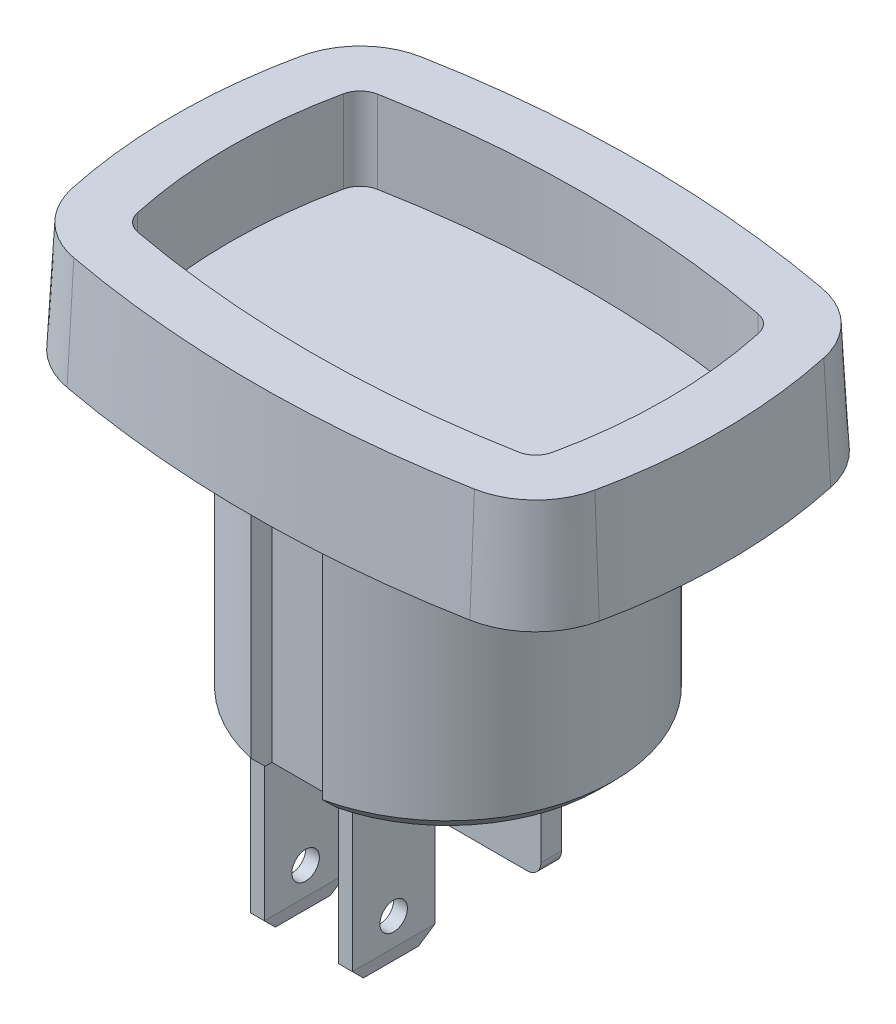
ISO-10303-21;
HEADER;
FILE_DESCRIPTION(('STEP AP214'),'2;1');
FILE_NAME('part.step','',(''),(''),'','','');
FILE_SCHEMA(('AUTOMOTIVE_DESIGN { 1 0 10303 214 1 1 1 1 }'));
ENDSEC;
DATA;
#1=APPLICATION_CONTEXT('core data for automotive mechanical design processes');
#2=APPLICATION_PROTOCOL_DEFINITION('international standard','automotive_design',2000,#1);
#3=PRODUCT_CONTEXT('',#1,'mechanical');
#4=PRODUCT('Part','Part','',(#3));
#5=PRODUCT_RELATED_PRODUCT_CATEGORY('part','',(#4));
#6=PRODUCT_DEFINITION_FORMATION('','',#4);
#7=PRODUCT_DEFINITION_CONTEXT('part definition',#1,'design');
#8=PRODUCT_DEFINITION('design','',#6,#7);
#9=PRODUCT_DEFINITION_SHAPE('','',#8);
#10=(LENGTH_UNIT() NAMED_UNIT(*) SI_UNIT(.MILLI.,.METRE.));
#11=(NAMED_UNIT(*) PLANE_ANGLE_UNIT() SI_UNIT($,.RADIAN.));
#12=(NAMED_UNIT(*) SI_UNIT($,.STERADIAN.) SOLID_ANGLE_UNIT());
#13=UNCERTAINTY_MEASURE_WITH_UNIT(LENGTH_MEASURE(1.E-05),#10,'distance_accuracy_value','');
#14=(GEOMETRIC_REPRESENTATION_CONTEXT(3) GLOBAL_UNCERTAINTY_ASSIGNED_CONTEXT((#13)) GLOBAL_UNIT_ASSIGNED_CONTEXT((#10,
#11,#12)) REPRESENTATION_CONTEXT('',''));
#15=CARTESIAN_POINT('',(0.,0.,0.));
#16=DIRECTION('',(0.,0.,1.));
#17=DIRECTION('',(1.,0.,0.));
#18=AXIS2_PLACEMENT_3D('',#15,#16,#17);
#19=CARTESIAN_POINT('',(0.,-9.5,0.));
#20=DIRECTION('',(0.,-1.,0.));
#21=DIRECTION('',(0.,0.,-1.));
#22=AXIS2_PLACEMENT_3D('',#19,#20,#21);
#23=PLANE('',#22);
#24=DIRECTION('',(1.,0.,0.));
#25=VECTOR('',#24,1.);
#26=CARTESIAN_POINT('',(-0.25,-9.5,0.724999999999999));
#27=LINE('',#26,#25);
#28=CARTESIAN_POINT('',(-0.25,-9.5,0.724999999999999));
#29=VERTEX_POINT('',#28);
#30=CARTESIAN_POINT('',(0.25,-9.5,0.724999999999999));
#31=VERTEX_POINT('',#30);
#32=EDGE_CURVE('E357',#29,#31,#27,.T.);
#33=ORIENTED_EDGE('',*,*,#32,.F.);
#34=DIRECTION('',(0.,0.,-1.));
#35=VECTOR('',#34,1.);
#36=CARTESIAN_POINT('',(-0.25,-9.5,3.725));
#37=LINE('',#36,#35);
#38=CARTESIAN_POINT('',(-0.25,-9.5,3.725));
#39=VERTEX_POINT('',#38);
#40=EDGE_CURVE('E330',#39,#29,#37,.T.);
#41=ORIENTED_EDGE('',*,*,#40,.F.);
#42=DIRECTION('',(-1.,0.,0.));
#43=VECTOR('',#42,1.);
#44=CARTESIAN_POINT('',(-0.25,-9.5,3.725));
#45=LINE('',#44,#43);
#46=CARTESIAN_POINT('',(0.25,-9.5,3.725));
#47=VERTEX_POINT('',#46);
#48=EDGE_CURVE('E363',#47,#39,#45,.T.);
#49=ORIENTED_EDGE('',*,*,#48,.F.);
#50=DIRECTION('',(0.,0.,1.));
#51=VECTOR('',#50,1.);
#52=CARTESIAN_POINT('',(0.25,-9.5,3.725));
#53=LINE('',#52,#51);
#54=EDGE_CURVE('E360',#31,#47,#53,.T.);
#55=ORIENTED_EDGE('',*,*,#54,.F.);
#56=EDGE_LOOP('',(#33,#41,#49,#55));
#57=FACE_BOUND('',#56,.T.);
#58=DIRECTION('',(-1.,0.,0.));
#59=VECTOR('',#58,1.);
#60=CARTESIAN_POINT('',(-3.75,-9.5,0.375));
#61=LINE('',#60,#59);
#62=CARTESIAN_POINT('',(3.75,-9.5,0.375));
#63=VERTEX_POINT('',#62);
#64=CARTESIAN_POINT('',(-3.75,-9.5,0.375));
#65=VERTEX_POINT('',#64);
#66=EDGE_CURVE('E387',#63,#65,#61,.T.);
#67=ORIENTED_EDGE('',*,*,#66,.F.);
#68=DIRECTION('',(0.,0.,-1.));
#69=VECTOR('',#68,1.);
#70=CARTESIAN_POINT('',(3.75,-9.5,0.375));
#71=LINE('',#70,#69);
#72=CARTESIAN_POINT('',(3.75,-9.5,-0.375));
#73=VERTEX_POINT('',#72);
#74=EDGE_CURVE('E404',#63,#73,#71,.T.);
#75=ORIENTED_EDGE('',*,*,#74,.T.);
#76=DIRECTION('',(-1.,0.,0.));
#77=VECTOR('',#76,1.);
#78=CARTESIAN_POINT('',(-3.75,-9.5,-0.375));
#79=LINE('',#78,#77);
#80=CARTESIAN_POINT('',(-3.75,-9.5,-0.375));
#81=VERTEX_POINT('',#80);
#82=EDGE_CURVE('E379',#73,#81,#79,.T.);
#83=ORIENTED_EDGE('',*,*,#82,.T.);
#84=DIRECTION('',(0.,0.,-1.));
#85=VECTOR('',#84,1.);
#86=CARTESIAN_POINT('',(-3.75,-9.5,0.375));
#87=LINE('',#86,#85);
#88=EDGE_CURVE('E389',#65,#81,#87,.T.);
#89=ORIENTED_EDGE('',*,*,#88,.F.);
#90=EDGE_LOOP('',(#67,#75,#83,#89));
#91=FACE_BOUND('',#90,.T.);
#92=DIRECTION('',(0.,0.,-1.));
#93=VECTOR('',#92,1.);
#94=CARTESIAN_POINT('',(-1.3,-9.5,-6.));
#95=LINE('',#94,#93);
#96=CARTESIAN_POINT('',(-1.3,-9.5,-5.1));
#97=VERTEX_POINT('',#96);
#98=CARTESIAN_POINT('',(-1.3,-9.5,-5.34415568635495));
#99=VERTEX_POINT('',#98);
#100=EDGE_CURVE('E430',#97,#99,#95,.T.);
#101=ORIENTED_EDGE('',*,*,#100,.F.);
#102=DIRECTION('',(-1.,0.,0.));
#103=VECTOR('',#102,1.);
#104=CARTESIAN_POINT('',(-1.3,-9.5,-5.1));
#105=LINE('',#104,#103);
#106=CARTESIAN_POINT('',(1.3,-9.5,-5.1));
#107=VERTEX_POINT('',#106);
#108=EDGE_CURVE('E427',#107,#97,#105,.T.);
#109=ORIENTED_EDGE('',*,*,#108,.F.);
#110=DIRECTION('',(0.,0.,1.));
#111=VECTOR('',#110,1.);
#112=CARTESIAN_POINT('',(1.3,-9.5,-6.));
#113=LINE('',#112,#111);
#114=CARTESIAN_POINT('',(1.3,-9.5,-5.34415568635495));
#115=VERTEX_POINT('',#114);
#116=EDGE_CURVE('E419',#115,#107,#113,.T.);
#117=ORIENTED_EDGE('',*,*,#116,.F.);
#118=CARTESIAN_POINT('',(0.,-9.5,0.));
#119=DIRECTION('',(0.,1.,0.));
#120=DIRECTION('',(0.,0.,1.));
#121=AXIS2_PLACEMENT_3D('',#118,#119,#120);
#122=CIRCLE('',#121,5.5);
#123=CARTESIAN_POINT('',(1.3,-9.5,5.34415568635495));
#124=VERTEX_POINT('',#123);
#125=EDGE_CURVE('E804',#124,#115,#122,.T.);
#126=ORIENTED_EDGE('',*,*,#125,.F.);
#127=DIRECTION('',(0.,0.,1.));
#128=VECTOR('',#127,1.);
#129=CARTESIAN_POINT('',(1.3,-9.5,6.));
#130=LINE('',#129,#128);
#131=CARTESIAN_POINT('',(1.3,-9.5,5.1));
#132=VERTEX_POINT('',#131);
#133=EDGE_CURVE('E856',#132,#124,#130,.T.);
#134=ORIENTED_EDGE('',*,*,#133,.F.);
#135=DIRECTION('',(1.,0.,0.));
#136=VECTOR('',#135,1.);
#137=CARTESIAN_POINT('',(-1.3,-9.5,5.1));
#138=LINE('',#137,#136);
#139=CARTESIAN_POINT('',(-1.3,-9.5,5.1));
#140=VERTEX_POINT('',#139);
#141=EDGE_CURVE('E853',#140,#132,#138,.T.);
#142=ORIENTED_EDGE('',*,*,#141,.F.);
#143=DIRECTION('',(0.,0.,-1.));
#144=VECTOR('',#143,1.);
#145=CARTESIAN_POINT('',(-1.3,-9.5,6.));
#146=LINE('',#145,#144);
#147=CARTESIAN_POINT('',(-1.3,-9.5,5.34415568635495));
#148=VERTEX_POINT('',#147);
#149=EDGE_CURVE('E846',#148,#140,#146,.T.);
#150=ORIENTED_EDGE('',*,*,#149,.F.);
#151=EDGE_CURVE('E827',#99,#148,#122,.T.);
#152=ORIENTED_EDGE('',*,*,#151,.F.);
#153=EDGE_LOOP('',(#101,#109,#117,#126,#134,#142,#150,#152));
#154=FACE_BOUND('',#153,.T.);
#155=DIRECTION('',(1.,0.,0.));
#156=VECTOR('',#155,1.);
#157=CARTESIAN_POINT('',(-3.45,-9.5,0.724999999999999));
#158=LINE('',#157,#156);
#159=CARTESIAN_POINT('',(-3.45,-9.5,0.724999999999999));
#160=VERTEX_POINT('',#159);
#161=CARTESIAN_POINT('',(-2.95,-9.5,0.724999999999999));
#162=VERTEX_POINT('',#161);
#163=EDGE_CURVE('E324',#160,#162,#158,.T.);
#164=ORIENTED_EDGE('',*,*,#163,.F.);
#165=DIRECTION('',(0.,0.,-1.));
#166=VECTOR('',#165,1.);
#167=CARTESIAN_POINT('',(-3.45,-9.5,3.725));
#168=LINE('',#167,#166);
#169=CARTESIAN_POINT('',(-3.45,-9.5,3.725));
#170=VERTEX_POINT('',#169);
#171=EDGE_CURVE('E334',#170,#160,#168,.T.);
#172=ORIENTED_EDGE('',*,*,#171,.F.);
#173=DIRECTION('',(-1.,0.,0.));
#174=VECTOR('',#173,1.);
#175=CARTESIAN_POINT('',(-3.45,-9.5,3.725));
#176=LINE('',#175,#174);
#177=CARTESIAN_POINT('',(-2.95,-9.5,3.725));
#178=VERTEX_POINT('',#177);
#179=EDGE_CURVE('E346',#178,#170,#176,.T.);
#180=ORIENTED_EDGE('',*,*,#179,.F.);
#181=DIRECTION('',(0.,0.,1.));
#182=VECTOR('',#181,1.);
#183=CARTESIAN_POINT('',(-2.95,-9.5,3.725));
#184=LINE('',#183,#182);
#185=EDGE_CURVE('E344',#162,#178,#184,.T.);
#186=ORIENTED_EDGE('',*,*,#185,.F.);
#187=EDGE_LOOP('',(#164,#172,#180,#186));
#188=FACE_BOUND('',#187,.T.);
#189=ADVANCED_FACE('F35',(#57,#91,#154,#188),#23,.T.);
#190=CARTESIAN_POINT('',(0.,-9.,0.));
#191=DIRECTION('',(0.,1.,0.));
#192=DIRECTION('',(0.,0.,1.));
#193=AXIS2_PLACEMENT_3D('',#190,#191,#192);
#194=CONICAL_SURFACE('',#193,6.,0.785398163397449);
#195=CARTESIAN_POINT('',(-1.3,-10.6885421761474,-4.11079901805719));
#196=CARTESIAN_POINT('',(-1.3,-10.5719118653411,-4.23311302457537));
#197=CARTESIAN_POINT('',(-1.3,-10.455043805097,-4.35519968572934));
#198=CARTESIAN_POINT('',(-1.3,-10.2209188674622,-4.59899888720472));
#199=CARTESIAN_POINT('',(-1.3,-10.103661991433,-4.72071142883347));
#200=CARTESIAN_POINT('',(-1.3,-9.75144000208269,-5.08540683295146));
#201=CARTESIAN_POINT('',(-1.3,-9.5160204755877,-5.32795066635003));
#202=CARTESIAN_POINT('',(-1.3,-9.04438692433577,-5.8122593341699));
#203=CARTESIAN_POINT('',(-1.3,-8.80817290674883,-6.05402417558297));
#204=CARTESIAN_POINT('',(-1.3,-8.33516626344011,-6.53699356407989));
#205=CARTESIAN_POINT('',(-1.3,-8.09837363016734,-6.77819810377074));
#206=CARTESIAN_POINT('',(-1.3,-7.86140379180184,-7.01922758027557));
#207=B_SPLINE_CURVE_WITH_KNOTS('',3,(#195,#196,#197,#198,#199,#200,#201,#202,#203,#204,#205,
#206),.UNSPECIFIED.,.F.,.F.,(4,2,2,2,2,4),(0.,0.507019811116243,1.01403784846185,
2.02806067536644,3.04207437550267,4.0561013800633),.UNSPECIFIED.);
#208=CARTESIAN_POINT('',(-1.3,-9.,-5.85747385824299));
#209=VERTEX_POINT('',#208);
#210=EDGE_CURVE('E444',#99,#209,#207,.T.);
#211=ORIENTED_EDGE('',*,*,#210,.F.);
#212=ORIENTED_EDGE('',*,*,#151,.T.);
#213=CARTESIAN_POINT('',(-1.3,-7.97437579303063,6.90430268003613));
#214=CARTESIAN_POINT('',(-1.3,-8.21127751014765,6.66320562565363));
#215=CARTESIAN_POINT('',(-1.3,-8.44799437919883,6.42192598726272));
#216=CARTESIAN_POINT('',(-1.3,-8.9208164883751,5.93877540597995));
#217=CARTESIAN_POINT('',(-1.3,-9.15692173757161,5.69690447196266));
#218=CARTESIAN_POINT('',(-1.3,-9.62828821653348,5.21233545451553));
#219=CARTESIAN_POINT('',(-1.3,-9.86354943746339,4.96963736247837));
#220=CARTESIAN_POINT('',(-1.3,-10.215468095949,4.60464802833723));
#221=CARTESIAN_POINT('',(-1.3,-10.332612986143,4.48282697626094));
#222=CARTESIAN_POINT('',(-1.3,-10.5664828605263,4.23878161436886));
#223=CARTESIAN_POINT('',(-1.3,-10.683207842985,4.11655730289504));
#224=CARTESIAN_POINT('',(-1.3,-10.7996749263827,3.99408697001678));
#225=B_SPLINE_CURVE_WITH_KNOTS('',3,(#213,#214,#215,#216,#217,#218,#219,#220,#221,#222,#223,
#224),.UNSPECIFIED.,.F.,.F.,(4,2,2,2,2,4),(0.,1.01402844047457,2.02804175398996,
3.04206565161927,3.54908512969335,4.05610669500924),.UNSPECIFIED.);
#226=CARTESIAN_POINT('',(-1.3,-9.,5.85747385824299));
#227=VERTEX_POINT('',#226);
#228=EDGE_CURVE('E477',#227,#148,#225,.T.);
#229=ORIENTED_EDGE('',*,*,#228,.F.);
#230=CARTESIAN_POINT('',(0.,-9.,0.));
#231=DIRECTION('',(0.,1.,0.));
#232=DIRECTION('',(0.,0.,1.));
#233=AXIS2_PLACEMENT_3D('',#230,#231,#232);
#234=CIRCLE('',#233,6.);
#235=EDGE_CURVE('E485',#209,#227,#234,.T.);
#236=ORIENTED_EDGE('',*,*,#235,.F.);
#237=EDGE_LOOP('',(#211,#212,#229,#236));
#238=FACE_BOUND('',#237,.T.);
#239=ADVANCED_FACE('F500',(#238),#194,.T.);
#240=CARTESIAN_POINT('',(0.,0.,0.));
#241=DIRECTION('',(0.,1.,0.));
#242=DIRECTION('',(0.,0.,1.));
#243=AXIS2_PLACEMENT_3D('',#240,#241,#242);
#244=CYLINDRICAL_SURFACE('',#243,6.);
#245=DIRECTION('',(0.,1.,0.));
#246=VECTOR('',#245,1.);
#247=CARTESIAN_POINT('',(-1.3,0.,-5.85747385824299));
#248=LINE('',#247,#246);
#249=CARTESIAN_POINT('',(-1.3,0.,-5.85747385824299));
#250=VERTEX_POINT('',#249);
#251=EDGE_CURVE('E689',#209,#250,#248,.T.);
#252=ORIENTED_EDGE('',*,*,#251,.F.);
#253=ORIENTED_EDGE('',*,*,#235,.T.);
#254=DIRECTION('',(0.,1.,0.));
#255=VECTOR('',#254,1.);
#256=CARTESIAN_POINT('',(-1.3,0.,5.85747385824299));
#257=LINE('',#256,#255);
#258=CARTESIAN_POINT('',(-1.3,0.,5.85747385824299));
#259=VERTEX_POINT('',#258);
#260=EDGE_CURVE('E694',#259,#227,#257,.F.);
#261=ORIENTED_EDGE('',*,*,#260,.F.);
#262=CARTESIAN_POINT('',(0.,0.,0.));
#263=DIRECTION('',(0.,-1.,0.));
#264=DIRECTION('',(0.,0.,-1.));
#265=AXIS2_PLACEMENT_3D('',#262,#263,#264);
#266=CIRCLE('',#265,6.);
#267=EDGE_CURVE('E700',#259,#250,#266,.T.);
#268=ORIENTED_EDGE('',*,*,#267,.T.);
#269=EDGE_LOOP('',(#252,#253,#261,#268));
#270=FACE_BOUND('',#269,.T.);
#271=ADVANCED_FACE('F494',(#270),#244,.T.);
#272=CARTESIAN_POINT('',(-6.7697609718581,0.,-3.57540840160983));
#273=DIRECTION('',(0.,-1.,0.));
#274=DIRECTION('',(0.,0.,-1.));
#275=AXIS2_PLACEMENT_3D('',#272,#273,#274);
#276=CONICAL_SURFACE('',#275,2.99999999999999,0.0523598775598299);
#277=CARTESIAN_POINT('',(-6.7697609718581,0.,-3.57540840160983));
#278=DIRECTION('',(0.,1.,0.));
#279=DIRECTION('',(0.,0.,-1.));
#280=AXIS2_PLACEMENT_3D('',#277,#278,#279);
#281=CIRCLE('',#280,2.99999999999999);
#282=CARTESIAN_POINT('',(-7.31866051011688,0.,-6.52476583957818));
#283=VERTEX_POINT('',#282);
#284=CARTESIAN_POINT('',(-9.70265996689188,0.,-4.20636282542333));
#285=VERTEX_POINT('',#284);
#286=EDGE_CURVE('E759',#283,#285,#281,.T.);
#287=ORIENTED_EDGE('',*,*,#286,.T.);
#288=DIRECTION('',(-0.0511653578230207,-0.998629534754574,-0.0110072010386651));
#289=VECTOR('',#288,1.);
#290=CARTESIAN_POINT('',(-9.70265996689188,0.,-4.20636282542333));
#291=LINE('',#290,#289);
#292=CARTESIAN_POINT('',(-9.49771766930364,4.,-4.1622735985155));
#293=VERTEX_POINT('',#292);
#294=EDGE_CURVE('E726',#293,#285,#291,.T.);
#295=ORIENTED_EDGE('',*,*,#294,.F.);
#296=CARTESIAN_POINT('',(-6.7697609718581,4.,-3.57540840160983));
#297=DIRECTION('',(0.,-1.,0.));
#298=DIRECTION('',(0.,0.,-1.));
#299=AXIS2_PLACEMENT_3D('',#296,#297,#298);
#300=CIRCLE('',#299,2.79036888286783);
#301=CARTESIAN_POINT('',(-7.28030503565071,4.,-6.3186734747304));
#302=VERTEX_POINT('',#301);
#303=EDGE_CURVE('E719',#302,#293,#300,.F.);
#304=ORIENTED_EDGE('',*,*,#303,.F.);
#305=DIRECTION('',(-0.00957572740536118,-0.998629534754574,-0.0514524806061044));
#306=VECTOR('',#305,1.);
#307=CARTESIAN_POINT('',(-7.31866051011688,0.,-6.52476583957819));
#308=LINE('',#307,#306);
#309=EDGE_CURVE('E706',#302,#283,#308,.T.);
#310=ORIENTED_EDGE('',*,*,#309,.T.);
#311=EDGE_LOOP('',(#287,#295,#304,#310));
#312=FACE_BOUND('',#311,.T.);
#313=ADVANCED_FACE('F503',(#312),#276,.T.);
#314=CARTESIAN_POINT('',(9.85,0.,0.));
#315=DIRECTION('',(0.,-1.,0.));
#316=DIRECTION('',(0.,0.,1.));
#317=AXIS2_PLACEMENT_3D('',#314,#315,#316);
#318=CONICAL_SURFACE('',#317,20.,0.0523598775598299);
#319=CARTESIAN_POINT('',(9.85,0.,0.));
#320=DIRECTION('',(0.,1.,0.));
#321=DIRECTION('',(0.,0.,1.));
#322=AXIS2_PLACEMENT_3D('',#319,#320,#321);
#323=CIRCLE('',#322,20.);
#324=CARTESIAN_POINT('',(-9.70265996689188,0.,4.20636282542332));
#325=VERTEX_POINT('',#324);
#326=EDGE_CURVE('E757',#285,#325,#323,.T.);
#327=ORIENTED_EDGE('',*,*,#326,.T.);
#328=DIRECTION('',(-0.0511653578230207,-0.998629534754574,0.011007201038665));
#329=VECTOR('',#328,1.);
#330=CARTESIAN_POINT('',(-9.70265996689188,0.,4.20636282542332));
#331=LINE('',#330,#329);
#332=CARTESIAN_POINT('',(-9.49771766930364,4.,4.16227359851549));
#333=VERTEX_POINT('',#332);
#334=EDGE_CURVE('E723',#333,#325,#331,.T.);
#335=ORIENTED_EDGE('',*,*,#334,.F.);
#336=CARTESIAN_POINT('',(9.85,4.,0.));
#337=DIRECTION('',(0.,-1.,0.));
#338=DIRECTION('',(0.,0.,-1.));
#339=AXIS2_PLACEMENT_3D('',#336,#337,#338);
#340=CIRCLE('',#339,19.7903688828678);
#341=EDGE_CURVE('E717',#293,#333,#340,.F.);
#342=ORIENTED_EDGE('',*,*,#341,.F.);
#343=ORIENTED_EDGE('',*,*,#294,.T.);
#344=EDGE_LOOP('',(#327,#335,#342,#343));
#345=FACE_BOUND('',#344,.T.);
#346=ADVANCED_FACE('F560',(#345),#318,.T.);
#347=CARTESIAN_POINT('',(-6.7697609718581,0.,3.57540840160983));
#348=DIRECTION('',(0.,-1.,0.));
#349=DIRECTION('',(0.,0.,1.));
#350=AXIS2_PLACEMENT_3D('',#347,#348,#349);
#351=CONICAL_SURFACE('',#350,3.,0.0523598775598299);
#352=CARTESIAN_POINT('',(-6.7697609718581,0.,3.57540840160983));
#353=DIRECTION('',(0.,1.,0.));
#354=DIRECTION('',(0.,0.,1.));
#355=AXIS2_PLACEMENT_3D('',#352,#353,#354);
#356=CIRCLE('',#355,3.);
#357=CARTESIAN_POINT('',(-7.31866051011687,0.,6.52476583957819));
#358=VERTEX_POINT('',#357);
#359=EDGE_CURVE('E755',#325,#358,#356,.T.);
#360=ORIENTED_EDGE('',*,*,#359,.T.);
#361=DIRECTION('',(-0.00957572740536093,-0.998629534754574,0.0514524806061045));
#362=VECTOR('',#361,1.);
#363=CARTESIAN_POINT('',(-7.31866051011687,0.,6.52476583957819));
#364=LINE('',#363,#362);
#365=CARTESIAN_POINT('',(-7.2803050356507,4.,6.3186734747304));
#366=VERTEX_POINT('',#365);
#367=EDGE_CURVE('E727',#366,#358,#364,.T.);
#368=ORIENTED_EDGE('',*,*,#367,.F.);
#369=CARTESIAN_POINT('',(-6.7697609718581,4.,3.57540840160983));
#370=DIRECTION('',(0.,-1.,0.));
#371=DIRECTION('',(0.,0.,-1.));
#372=AXIS2_PLACEMENT_3D('',#369,#370,#371);
#373=CIRCLE('',#372,2.79036888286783);
#374=EDGE_CURVE('E715',#333,#366,#373,.F.);
#375=ORIENTED_EDGE('',*,*,#374,.F.);
#376=ORIENTED_EDGE('',*,*,#334,.T.);
#377=EDGE_LOOP('',(#360,#368,#375,#376));
#378=FACE_BOUND('',#377,.T.);
#379=ADVANCED_FACE('F580',(#378),#351,.T.);
#380=CARTESIAN_POINT('',(0.,0.,-32.8));
#381=DIRECTION('',(0.,-1.,0.));
#382=DIRECTION('',(0.,0.,1.));
#383=AXIS2_PLACEMENT_3D('',#380,#381,#382);
#384=CONICAL_SURFACE('',#383,40.,0.0523598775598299);
#385=CARTESIAN_POINT('',(0.,0.,-32.8));
#386=DIRECTION('',(0.,1.,0.));
#387=DIRECTION('',(0.,0.,1.));
#388=AXIS2_PLACEMENT_3D('',#385,#386,#387);
#389=CIRCLE('',#388,40.);
#390=CARTESIAN_POINT('',(7.31866051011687,0.,6.52476583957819));
#391=VERTEX_POINT('',#390);
#392=EDGE_CURVE('E753',#358,#391,#389,.T.);
#393=ORIENTED_EDGE('',*,*,#392,.T.);
#394=DIRECTION('',(0.00957572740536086,-0.998629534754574,0.0514524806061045));
#395=VECTOR('',#394,1.);
#396=CARTESIAN_POINT('',(7.31866051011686,0.,6.52476583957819));
#397=LINE('',#396,#395);
#398=CARTESIAN_POINT('',(7.28030503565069,4.,6.3186734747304));
#399=VERTEX_POINT('',#398);
#400=EDGE_CURVE('E730',#399,#391,#397,.T.);
#401=ORIENTED_EDGE('',*,*,#400,.F.);
#402=CARTESIAN_POINT('',(0.,4.,-32.8));
#403=DIRECTION('',(0.,-1.,0.));
#404=DIRECTION('',(0.,0.,-1.));
#405=AXIS2_PLACEMENT_3D('',#402,#403,#404);
#406=CIRCLE('',#405,39.7903688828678);
#407=EDGE_CURVE('E713',#366,#399,#406,.F.);
#408=ORIENTED_EDGE('',*,*,#407,.F.);
#409=ORIENTED_EDGE('',*,*,#367,.T.);
#410=EDGE_LOOP('',(#393,#401,#408,#409));
#411=FACE_BOUND('',#410,.T.);
#412=ADVANCED_FACE('F576',(#411),#384,.T.);
#413=CARTESIAN_POINT('',(6.7697609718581,0.,3.57540840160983));
#414=DIRECTION('',(0.,-1.,0.));
#415=DIRECTION('',(0.,0.,-1.));
#416=AXIS2_PLACEMENT_3D('',#413,#414,#415);
#417=CONICAL_SURFACE('',#416,3.,0.0523598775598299);
#418=CARTESIAN_POINT('',(6.7697609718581,0.,3.57540840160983));
#419=DIRECTION('',(0.,1.,0.));
#420=DIRECTION('',(0.,0.,-1.));
#421=AXIS2_PLACEMENT_3D('',#418,#419,#420);
#422=CIRCLE('',#421,3.);
#423=CARTESIAN_POINT('',(9.70265996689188,0.,4.20636282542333));
#424=VERTEX_POINT('',#423);
#425=EDGE_CURVE('E751',#391,#424,#422,.T.);
#426=ORIENTED_EDGE('',*,*,#425,.T.);
#427=DIRECTION('',(0.0511653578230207,-0.998629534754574,0.0110072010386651));
#428=VECTOR('',#427,1.);
#429=CARTESIAN_POINT('',(9.70265996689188,0.,4.20636282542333));
#430=LINE('',#429,#428);
#431=CARTESIAN_POINT('',(9.49771766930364,4.,4.16227359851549));
#432=VERTEX_POINT('',#431);
#433=EDGE_CURVE('E733',#432,#424,#430,.T.);
#434=ORIENTED_EDGE('',*,*,#433,.F.);
#435=CARTESIAN_POINT('',(6.7697609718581,4.,3.57540840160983));
#436=DIRECTION('',(0.,-1.,0.));
#437=DIRECTION('',(0.,0.,-1.));
#438=AXIS2_PLACEMENT_3D('',#435,#436,#437);
#439=CIRCLE('',#438,2.79036888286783);
#440=EDGE_CURVE('E711',#399,#432,#439,.F.);
#441=ORIENTED_EDGE('',*,*,#440,.F.);
#442=ORIENTED_EDGE('',*,*,#400,.T.);
#443=EDGE_LOOP('',(#426,#434,#441,#442));
#444=FACE_BOUND('',#443,.T.);
#445=ADVANCED_FACE('F572',(#444),#417,.T.);
#446=CARTESIAN_POINT('',(-9.85,0.,0.));
#447=DIRECTION('',(0.,-1.,0.));
#448=DIRECTION('',(0.,0.,-1.));
#449=AXIS2_PLACEMENT_3D('',#446,#447,#448);
#450=CONICAL_SURFACE('',#449,20.,0.0523598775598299);
#451=CARTESIAN_POINT('',(-9.85,0.,0.));
#452=DIRECTION('',(0.,1.,0.));
#453=DIRECTION('',(0.,0.,-1.));
#454=AXIS2_PLACEMENT_3D('',#451,#452,#453);
#455=CIRCLE('',#454,20.);
#456=CARTESIAN_POINT('',(9.70265996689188,0.,-4.20636282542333));
#457=VERTEX_POINT('',#456);
#458=EDGE_CURVE('E749',#424,#457,#455,.T.);
#459=ORIENTED_EDGE('',*,*,#458,.T.);
#460=DIRECTION('',(0.0511653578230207,-0.998629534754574,-0.0110072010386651));
#461=VECTOR('',#460,1.);
#462=CARTESIAN_POINT('',(9.70265996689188,0.,-4.20636282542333));
#463=LINE('',#462,#461);
#464=CARTESIAN_POINT('',(9.49771766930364,4.,-4.16227359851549));
#465=VERTEX_POINT('',#464);
#466=EDGE_CURVE('E736',#465,#457,#463,.T.);
#467=ORIENTED_EDGE('',*,*,#466,.F.);
#468=CARTESIAN_POINT('',(-9.85,4.,0.));
#469=DIRECTION('',(0.,-1.,0.));
#470=DIRECTION('',(0.,0.,-1.));
#471=AXIS2_PLACEMENT_3D('',#468,#469,#470);
#472=CIRCLE('',#471,19.7903688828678);
#473=EDGE_CURVE('E709',#432,#465,#472,.F.);
#474=ORIENTED_EDGE('',*,*,#473,.F.);
#475=ORIENTED_EDGE('',*,*,#433,.T.);
#476=EDGE_LOOP('',(#459,#467,#474,#475));
#477=FACE_BOUND('',#476,.T.);
#478=ADVANCED_FACE('F568',(#477),#450,.T.);
#479=CARTESIAN_POINT('',(6.7697609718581,0.,-3.57540840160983));
#480=DIRECTION('',(0.,-1.,0.));
#481=DIRECTION('',(0.,0.,1.));
#482=AXIS2_PLACEMENT_3D('',#479,#480,#481);
#483=CONICAL_SURFACE('',#482,2.99999999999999,0.0523598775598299);
#484=CARTESIAN_POINT('',(6.7697609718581,0.,-3.57540840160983));
#485=DIRECTION('',(0.,1.,0.));
#486=DIRECTION('',(0.,0.,1.));
#487=AXIS2_PLACEMENT_3D('',#484,#485,#486);
#488=CIRCLE('',#487,2.99999999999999);
#489=CARTESIAN_POINT('',(7.31866051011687,0.,-6.52476583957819));
#490=VERTEX_POINT('',#489);
#491=EDGE_CURVE('E747',#457,#490,#488,.T.);
#492=ORIENTED_EDGE('',*,*,#491,.T.);
#493=DIRECTION('',(0.00957572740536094,-0.998629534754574,-0.0514524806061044));
#494=VECTOR('',#493,1.);
#495=CARTESIAN_POINT('',(7.31866051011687,0.,-6.52476583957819));
#496=LINE('',#495,#494);
#497=CARTESIAN_POINT('',(7.2803050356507,4.,-6.3186734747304));
#498=VERTEX_POINT('',#497);
#499=EDGE_CURVE('E739',#498,#490,#496,.T.);
#500=ORIENTED_EDGE('',*,*,#499,.F.);
#501=CARTESIAN_POINT('',(6.7697609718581,4.,-3.57540840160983));
#502=DIRECTION('',(0.,-1.,0.));
#503=DIRECTION('',(0.,0.,-1.));
#504=AXIS2_PLACEMENT_3D('',#501,#502,#503);
#505=CIRCLE('',#504,2.79036888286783);
#506=EDGE_CURVE('E707',#465,#498,#505,.F.);
#507=ORIENTED_EDGE('',*,*,#506,.F.);
#508=ORIENTED_EDGE('',*,*,#466,.T.);
#509=EDGE_LOOP('',(#492,#500,#507,#508));
#510=FACE_BOUND('',#509,.T.);
#511=ADVANCED_FACE('F564',(#510),#483,.T.);
#512=CARTESIAN_POINT('',(0.,0.,32.8));
#513=DIRECTION('',(0.,-1.,0.));
#514=DIRECTION('',(0.,0.,-1.));
#515=AXIS2_PLACEMENT_3D('',#512,#513,#514);
#516=CONICAL_SURFACE('',#515,40.,0.0523598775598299);
#517=CARTESIAN_POINT('',(0.,0.,32.8));
#518=DIRECTION('',(0.,1.,0.));
#519=DIRECTION('',(0.,0.,-1.));
#520=AXIS2_PLACEMENT_3D('',#517,#518,#519);
#521=CIRCLE('',#520,40.);
#522=EDGE_CURVE('E722',#490,#283,#521,.T.);
#523=ORIENTED_EDGE('',*,*,#522,.T.);
#524=ORIENTED_EDGE('',*,*,#309,.F.);
#525=CARTESIAN_POINT('',(0.,4.,32.8));
#526=DIRECTION('',(0.,-1.,0.));
#527=DIRECTION('',(0.,0.,-1.));
#528=AXIS2_PLACEMENT_3D('',#525,#526,#527);
#529=CIRCLE('',#528,39.7903688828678);
#530=EDGE_CURVE('E704',#498,#302,#529,.F.);
#531=ORIENTED_EDGE('',*,*,#530,.F.);
#532=ORIENTED_EDGE('',*,*,#499,.T.);
#533=EDGE_LOOP('',(#523,#524,#531,#532));
#534=FACE_BOUND('',#533,.T.);
#535=ADVANCED_FACE('F553',(#534),#516,.T.);
#536=CARTESIAN_POINT('',(-3.38488048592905,4.,14.6122957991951));
#537=DIRECTION('',(0.,-1.,0.));
#538=DIRECTION('',(0.,0.,-1.));
#539=AXIS2_PLACEMENT_3D('',#536,#537,#538);
#540=PLANE('',#539);
#541=CARTESIAN_POINT('',(-6.7697609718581,4.,-3.57540840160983));
#542=DIRECTION('',(0.,1.,0.));
#543=DIRECTION('',(0.,0.,1.));
#544=AXIS2_PLACEMENT_3D('',#541,#542,#543);
#545=CIRCLE('',#544,0.790368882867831);
#546=CARTESIAN_POINT('',(-6.91437201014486,4.,-4.35243518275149));
#547=VERTEX_POINT('',#546);
#548=CARTESIAN_POINT('',(-7.54245167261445,4.,-3.74163731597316));
#549=VERTEX_POINT('',#548);
#550=EDGE_CURVE('E799',#547,#549,#545,.T.);
#551=ORIENTED_EDGE('',*,*,#550,.F.);
#552=CARTESIAN_POINT('',(0.,4.,32.8));
#553=DIRECTION('',(0.,1.,0.));
#554=DIRECTION('',(0.,0.,1.));
#555=AXIS2_PLACEMENT_3D('',#552,#553,#554);
#556=CIRCLE('',#555,37.7903688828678);
#557=CARTESIAN_POINT('',(6.91437201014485,4.,-4.35243518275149));
#558=VERTEX_POINT('',#557);
#559=EDGE_CURVE('E802',#558,#547,#556,.T.);
#560=ORIENTED_EDGE('',*,*,#559,.F.);
#561=CARTESIAN_POINT('',(6.7697609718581,4.,-3.57540840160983));
#562=DIRECTION('',(0.,1.,0.));
#563=DIRECTION('',(0.,0.,1.));
#564=AXIS2_PLACEMENT_3D('',#561,#562,#563);
#565=CIRCLE('',#564,0.790368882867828);
#566=CARTESIAN_POINT('',(7.54245167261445,4.,-3.74163731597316));
#567=VERTEX_POINT('',#566);
#568=EDGE_CURVE('E780',#567,#558,#565,.T.);
#569=ORIENTED_EDGE('',*,*,#568,.F.);
#570=CARTESIAN_POINT('',(-9.85,4.,0.));
#571=DIRECTION('',(0.,1.,0.));
#572=DIRECTION('',(0.,0.,1.));
#573=AXIS2_PLACEMENT_3D('',#570,#571,#572);
#574=CIRCLE('',#573,17.7903688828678);
#575=CARTESIAN_POINT('',(7.54245167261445,4.,3.74163731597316));
#576=VERTEX_POINT('',#575);
#577=EDGE_CURVE('E784',#576,#567,#574,.T.);
#578=ORIENTED_EDGE('',*,*,#577,.F.);
#579=CARTESIAN_POINT('',(6.7697609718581,4.,3.57540840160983));
#580=DIRECTION('',(0.,1.,0.));
#581=DIRECTION('',(0.,0.,1.));
#582=AXIS2_PLACEMENT_3D('',#579,#580,#581);
#583=CIRCLE('',#582,0.790368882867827);
#584=CARTESIAN_POINT('',(6.91437201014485,4.,4.35243518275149));
#585=VERTEX_POINT('',#584);
#586=EDGE_CURVE('E787',#585,#576,#583,.T.);
#587=ORIENTED_EDGE('',*,*,#586,.F.);
#588=CARTESIAN_POINT('',(0.,4.,-32.8));
#589=DIRECTION('',(0.,1.,0.));
#590=DIRECTION('',(0.,0.,1.));
#591=AXIS2_PLACEMENT_3D('',#588,#589,#590);
#592=CIRCLE('',#591,37.7903688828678);
#593=CARTESIAN_POINT('',(-6.91437201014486,4.,4.35243518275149));
#594=VERTEX_POINT('',#593);
#595=EDGE_CURVE('E790',#594,#585,#592,.T.);
#596=ORIENTED_EDGE('',*,*,#595,.F.);
#597=CARTESIAN_POINT('',(-6.7697609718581,4.,3.57540840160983));
#598=DIRECTION('',(0.,1.,0.));
#599=DIRECTION('',(0.,0.,1.));
#600=AXIS2_PLACEMENT_3D('',#597,#598,#599);
#601=CIRCLE('',#600,0.790368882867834);
#602=CARTESIAN_POINT('',(-7.54245167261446,4.,3.74163731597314));
#603=VERTEX_POINT('',#602);
#604=EDGE_CURVE('E793',#603,#594,#601,.T.);
#605=ORIENTED_EDGE('',*,*,#604,.F.);
#606=CARTESIAN_POINT('',(9.85,4.,0.));
#607=DIRECTION('',(0.,1.,0.));
#608=DIRECTION('',(0.,0.,1.));
#609=AXIS2_PLACEMENT_3D('',#606,#607,#608);
#610=CIRCLE('',#609,17.7903688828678);
#611=EDGE_CURVE('E796',#549,#603,#610,.T.);
#612=ORIENTED_EDGE('',*,*,#611,.F.);
#613=EDGE_LOOP('',(#551,#560,#569,#578,#587,#596,#605,#612));
#614=FACE_BOUND('',#613,.T.);
#615=ORIENTED_EDGE('',*,*,#303,.T.);
#616=ORIENTED_EDGE('',*,*,#341,.T.);
#617=ORIENTED_EDGE('',*,*,#374,.T.);
#618=ORIENTED_EDGE('',*,*,#407,.T.);
#619=ORIENTED_EDGE('',*,*,#440,.T.);
#620=ORIENTED_EDGE('',*,*,#473,.T.);
#621=ORIENTED_EDGE('',*,*,#506,.T.);
#622=ORIENTED_EDGE('',*,*,#530,.T.);
#623=EDGE_LOOP('',(#615,#616,#617,#618,#619,#620,#621,#622));
#624=FACE_BOUND('',#623,.T.);
#625=ADVANCED_FACE('F550',(#614,#624),#540,.F.);
#626=CARTESIAN_POINT('',(-3.38488048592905,0.,14.6122957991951));
#627=DIRECTION('',(0.,-1.,0.));
#628=DIRECTION('',(0.,0.,-1.));
#629=AXIS2_PLACEMENT_3D('',#626,#627,#628);
#630=PLANE('',#629);
#631=DIRECTION('',(0.,0.,1.));
#632=VECTOR('',#631,1.);
#633=CARTESIAN_POINT('',(-1.3,0.,-6.));
#634=LINE('',#633,#632);
#635=CARTESIAN_POINT('',(-1.3,0.,-5.1));
#636=VERTEX_POINT('',#635);
#637=EDGE_CURVE('E422',#250,#636,#634,.T.);
#638=ORIENTED_EDGE('',*,*,#637,.F.);
#639=ORIENTED_EDGE('',*,*,#267,.F.);
#640=DIRECTION('',(0.,0.,1.));
#641=VECTOR('',#640,1.);
#642=CARTESIAN_POINT('',(-1.3,0.,6.));
#643=LINE('',#642,#641);
#644=CARTESIAN_POINT('',(-1.3,0.,5.1));
#645=VERTEX_POINT('',#644);
#646=EDGE_CURVE('E844',#645,#259,#643,.T.);
#647=ORIENTED_EDGE('',*,*,#646,.F.);
#648=DIRECTION('',(-1.,0.,0.));
#649=VECTOR('',#648,1.);
#650=CARTESIAN_POINT('',(-1.3,0.,5.1));
#651=LINE('',#650,#649);
#652=CARTESIAN_POINT('',(1.3,0.,5.1));
#653=VERTEX_POINT('',#652);
#654=EDGE_CURVE('E478',#653,#645,#651,.T.);
#655=ORIENTED_EDGE('',*,*,#654,.F.);
#656=DIRECTION('',(0.,0.,-1.));
#657=VECTOR('',#656,1.);
#658=CARTESIAN_POINT('',(1.3,0.,6.));
#659=LINE('',#658,#657);
#660=CARTESIAN_POINT('',(1.3,0.,5.85747385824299));
#661=VERTEX_POINT('',#660);
#662=EDGE_CURVE('E863',#661,#653,#659,.T.);
#663=ORIENTED_EDGE('',*,*,#662,.F.);
#664=CARTESIAN_POINT('',(1.3,0.,-5.85747385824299));
#665=VERTEX_POINT('',#664);
#666=EDGE_CURVE('E703',#665,#661,#266,.T.);
#667=ORIENTED_EDGE('',*,*,#666,.F.);
#668=DIRECTION('',(0.,0.,-1.));
#669=VECTOR('',#668,1.);
#670=CARTESIAN_POINT('',(1.3,0.,-6.));
#671=LINE('',#670,#669);
#672=CARTESIAN_POINT('',(1.3,0.,-5.1));
#673=VERTEX_POINT('',#672);
#674=EDGE_CURVE('E425',#673,#665,#671,.T.);
#675=ORIENTED_EDGE('',*,*,#674,.F.);
#676=DIRECTION('',(1.,0.,0.));
#677=VECTOR('',#676,1.);
#678=CARTESIAN_POINT('',(-1.3,0.,-5.1));
#679=LINE('',#678,#677);
#680=EDGE_CURVE('E420',#636,#673,#679,.T.);
#681=ORIENTED_EDGE('',*,*,#680,.F.);
#682=EDGE_LOOP('',(#638,#639,#647,#655,#663,#667,#675,#681));
#683=FACE_BOUND('',#682,.T.);
#684=ORIENTED_EDGE('',*,*,#286,.F.);
#685=ORIENTED_EDGE('',*,*,#522,.F.);
#686=ORIENTED_EDGE('',*,*,#491,.F.);
#687=ORIENTED_EDGE('',*,*,#458,.F.);
#688=ORIENTED_EDGE('',*,*,#425,.F.);
#689=ORIENTED_EDGE('',*,*,#392,.F.);
#690=ORIENTED_EDGE('',*,*,#359,.F.);
#691=ORIENTED_EDGE('',*,*,#326,.F.);
#692=EDGE_LOOP('',(#684,#685,#686,#687,#688,#689,#690,#691));
#693=FACE_BOUND('',#692,.T.);
#694=ADVANCED_FACE('F548',(#683,#693),#630,.T.);
#695=CARTESIAN_POINT('',(0.,1.,32.8));
#696=DIRECTION('',(0.,1.,0.));
#697=DIRECTION('',(0.,0.,1.));
#698=AXIS2_PLACEMENT_3D('',#695,#696,#697);
#699=CYLINDRICAL_SURFACE('',#698,37.7903688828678);
#700=ORIENTED_EDGE('',*,*,#559,.T.);
#701=DIRECTION('',(0.,1.,0.));
#702=VECTOR('',#701,1.);
#703=CARTESIAN_POINT('',(-6.91437201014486,1.,-4.35243518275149));
#704=LINE('',#703,#702);
#705=CARTESIAN_POINT('',(-6.91437201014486,1.,-4.35243518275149));
#706=VERTEX_POINT('',#705);
#707=EDGE_CURVE('E763',#706,#547,#704,.T.);
#708=ORIENTED_EDGE('',*,*,#707,.F.);
#709=CARTESIAN_POINT('',(0.,1.,32.8));
#710=DIRECTION('',(0.,1.,0.));
#711=DIRECTION('',(0.,0.,1.));
#712=AXIS2_PLACEMENT_3D('',#709,#710,#711);
#713=CIRCLE('',#712,37.7903688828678);
#714=CARTESIAN_POINT('',(6.91437201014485,1.,-4.35243518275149));
#715=VERTEX_POINT('',#714);
#716=EDGE_CURVE('E783',#715,#706,#713,.T.);
#717=ORIENTED_EDGE('',*,*,#716,.F.);
#718=DIRECTION('',(0.,1.,0.));
#719=VECTOR('',#718,1.);
#720=CARTESIAN_POINT('',(6.91437201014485,1.,-4.35243518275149));
#721=LINE('',#720,#719);
#722=EDGE_CURVE('E762',#715,#558,#721,.T.);
#723=ORIENTED_EDGE('',*,*,#722,.T.);
#724=EDGE_LOOP('',(#700,#708,#717,#723));
#725=FACE_BOUND('',#724,.T.);
#726=ADVANCED_FACE('F522',(#725),#699,.F.);
#727=CARTESIAN_POINT('',(6.7697609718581,1.,-3.57540840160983));
#728=DIRECTION('',(0.,1.,0.));
#729=DIRECTION('',(0.,0.,1.));
#730=AXIS2_PLACEMENT_3D('',#727,#728,#729);
#731=CYLINDRICAL_SURFACE('',#730,0.790368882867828);
#732=ORIENTED_EDGE('',*,*,#568,.T.);
#733=ORIENTED_EDGE('',*,*,#722,.F.);
#734=CARTESIAN_POINT('',(6.7697609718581,1.,-3.57540840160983));
#735=DIRECTION('',(0.,1.,0.));
#736=DIRECTION('',(0.,0.,1.));
#737=AXIS2_PLACEMENT_3D('',#734,#735,#736);
#738=CIRCLE('',#737,0.790368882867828);
#739=CARTESIAN_POINT('',(7.54245167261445,1.,-3.74163731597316));
#740=VERTEX_POINT('',#739);
#741=EDGE_CURVE('E767',#740,#715,#738,.T.);
#742=ORIENTED_EDGE('',*,*,#741,.F.);
#743=DIRECTION('',(0.,1.,0.));
#744=VECTOR('',#743,1.);
#745=CARTESIAN_POINT('',(7.54245167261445,1.,-3.74163731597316));
#746=LINE('',#745,#744);
#747=EDGE_CURVE('E777',#740,#567,#746,.T.);
#748=ORIENTED_EDGE('',*,*,#747,.T.);
#749=EDGE_LOOP('',(#732,#733,#742,#748));
#750=FACE_BOUND('',#749,.T.);
#751=ADVANCED_FACE('F518',(#750),#731,.F.);
#752=CARTESIAN_POINT('',(-9.85,1.,0.));
#753=DIRECTION('',(0.,1.,0.));
#754=DIRECTION('',(0.,0.,1.));
#755=AXIS2_PLACEMENT_3D('',#752,#753,#754);
#756=CYLINDRICAL_SURFACE('',#755,17.7903688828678);
#757=ORIENTED_EDGE('',*,*,#577,.T.);
#758=ORIENTED_EDGE('',*,*,#747,.F.);
#759=CARTESIAN_POINT('',(-9.85,1.,0.));
#760=DIRECTION('',(0.,1.,0.));
#761=DIRECTION('',(0.,0.,1.));
#762=AXIS2_PLACEMENT_3D('',#759,#760,#761);
#763=CIRCLE('',#762,17.7903688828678);
#764=CARTESIAN_POINT('',(7.54245167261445,1.,3.74163731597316));
#765=VERTEX_POINT('',#764);
#766=EDGE_CURVE('E807',#765,#740,#763,.T.);
#767=ORIENTED_EDGE('',*,*,#766,.F.);
#768=DIRECTION('',(0.,1.,0.));
#769=VECTOR('',#768,1.);
#770=CARTESIAN_POINT('',(7.54245167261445,1.,3.74163731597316));
#771=LINE('',#770,#769);
#772=EDGE_CURVE('E775',#765,#576,#771,.T.);
#773=ORIENTED_EDGE('',*,*,#772,.T.);
#774=EDGE_LOOP('',(#757,#758,#767,#773));
#775=FACE_BOUND('',#774,.T.);
#776=ADVANCED_FACE('F521',(#775),#756,.F.);
#777=CARTESIAN_POINT('',(6.7697609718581,1.,3.57540840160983));
#778=DIRECTION('',(0.,1.,0.));
#779=DIRECTION('',(0.,0.,1.));
#780=AXIS2_PLACEMENT_3D('',#777,#778,#779);
#781=CYLINDRICAL_SURFACE('',#780,0.790368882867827);
#782=ORIENTED_EDGE('',*,*,#586,.T.);
#783=ORIENTED_EDGE('',*,*,#772,.F.);
#784=CARTESIAN_POINT('',(6.7697609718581,1.,3.57540840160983));
#785=DIRECTION('',(0.,1.,0.));
#786=DIRECTION('',(0.,0.,1.));
#787=AXIS2_PLACEMENT_3D('',#784,#785,#786);
#788=CIRCLE('',#787,0.790368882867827);
#789=CARTESIAN_POINT('',(6.91437201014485,1.,4.35243518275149));
#790=VERTEX_POINT('',#789);
#791=EDGE_CURVE('E810',#790,#765,#788,.T.);
#792=ORIENTED_EDGE('',*,*,#791,.F.);
#793=DIRECTION('',(0.,1.,0.));
#794=VECTOR('',#793,1.);
#795=CARTESIAN_POINT('',(6.91437201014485,1.,4.35243518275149));
#796=LINE('',#795,#794);
#797=EDGE_CURVE('E773',#790,#585,#796,.T.);
#798=ORIENTED_EDGE('',*,*,#797,.T.);
#799=EDGE_LOOP('',(#782,#783,#792,#798));
#800=FACE_BOUND('',#799,.T.);
#801=ADVANCED_FACE('F526',(#800),#781,.F.);
#802=CARTESIAN_POINT('',(0.,1.,-32.8));
#803=DIRECTION('',(0.,1.,0.));
#804=DIRECTION('',(0.,0.,1.));
#805=AXIS2_PLACEMENT_3D('',#802,#803,#804);
#806=CYLINDRICAL_SURFACE('',#805,37.7903688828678);
#807=ORIENTED_EDGE('',*,*,#595,.T.);
#808=ORIENTED_EDGE('',*,*,#797,.F.);
#809=CARTESIAN_POINT('',(0.,1.,-32.8));
#810=DIRECTION('',(0.,1.,0.));
#811=DIRECTION('',(0.,0.,1.));
#812=AXIS2_PLACEMENT_3D('',#809,#810,#811);
#813=CIRCLE('',#812,37.7903688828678);
#814=CARTESIAN_POINT('',(-6.91437201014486,1.,4.35243518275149));
#815=VERTEX_POINT('',#814);
#816=EDGE_CURVE('E813',#815,#790,#813,.T.);
#817=ORIENTED_EDGE('',*,*,#816,.F.);
#818=DIRECTION('',(0.,1.,0.));
#819=VECTOR('',#818,1.);
#820=CARTESIAN_POINT('',(-6.91437201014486,1.,4.35243518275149));
#821=LINE('',#820,#819);
#822=EDGE_CURVE('E771',#815,#594,#821,.T.);
#823=ORIENTED_EDGE('',*,*,#822,.T.);
#824=EDGE_LOOP('',(#807,#808,#817,#823));
#825=FACE_BOUND('',#824,.T.);
#826=ADVANCED_FACE('F530',(#825),#806,.F.);
#827=CARTESIAN_POINT('',(-6.7697609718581,1.,3.57540840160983));
#828=DIRECTION('',(0.,1.,0.));
#829=DIRECTION('',(0.,0.,1.));
#830=AXIS2_PLACEMENT_3D('',#827,#828,#829);
#831=CYLINDRICAL_SURFACE('',#830,0.790368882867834);
#832=ORIENTED_EDGE('',*,*,#604,.T.);
#833=ORIENTED_EDGE('',*,*,#822,.F.);
#834=CARTESIAN_POINT('',(-6.7697609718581,1.,3.57540840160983));
#835=DIRECTION('',(0.,1.,0.));
#836=DIRECTION('',(0.,0.,1.));
#837=AXIS2_PLACEMENT_3D('',#834,#835,#836);
#838=CIRCLE('',#837,0.790368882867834);
#839=CARTESIAN_POINT('',(-7.54245167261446,1.,3.74163731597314));
#840=VERTEX_POINT('',#839);
#841=EDGE_CURVE('E816',#840,#815,#838,.T.);
#842=ORIENTED_EDGE('',*,*,#841,.F.);
#843=DIRECTION('',(0.,1.,0.));
#844=VECTOR('',#843,1.);
#845=CARTESIAN_POINT('',(-7.54245167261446,1.,3.74163731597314));
#846=LINE('',#845,#844);
#847=EDGE_CURVE('E769',#840,#603,#846,.T.);
#848=ORIENTED_EDGE('',*,*,#847,.T.);
#849=EDGE_LOOP('',(#832,#833,#842,#848));
#850=FACE_BOUND('',#849,.T.);
#851=ADVANCED_FACE('F534',(#850),#831,.F.);
#852=CARTESIAN_POINT('',(9.85,1.,0.));
#853=DIRECTION('',(0.,1.,0.));
#854=DIRECTION('',(0.,0.,1.));
#855=AXIS2_PLACEMENT_3D('',#852,#853,#854);
#856=CYLINDRICAL_SURFACE('',#855,17.7903688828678);
#857=ORIENTED_EDGE('',*,*,#611,.T.);
#858=ORIENTED_EDGE('',*,*,#847,.F.);
#859=CARTESIAN_POINT('',(9.85,1.,0.));
#860=DIRECTION('',(0.,1.,0.));
#861=DIRECTION('',(0.,0.,1.));
#862=AXIS2_PLACEMENT_3D('',#859,#860,#861);
#863=CIRCLE('',#862,17.7903688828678);
#864=CARTESIAN_POINT('',(-7.54245167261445,1.,-3.74163731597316));
#865=VERTEX_POINT('',#864);
#866=EDGE_CURVE('E819',#865,#840,#863,.T.);
#867=ORIENTED_EDGE('',*,*,#866,.F.);
#868=DIRECTION('',(0.,1.,0.));
#869=VECTOR('',#868,1.);
#870=CARTESIAN_POINT('',(-7.54245167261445,1.,-3.74163731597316));
#871=LINE('',#870,#869);
#872=EDGE_CURVE('E766',#865,#549,#871,.T.);
#873=ORIENTED_EDGE('',*,*,#872,.T.);
#874=EDGE_LOOP('',(#857,#858,#867,#873));
#875=FACE_BOUND('',#874,.T.);
#876=ADVANCED_FACE('F538',(#875),#856,.F.);
#877=CARTESIAN_POINT('',(-6.7697609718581,1.,-3.57540840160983));
#878=DIRECTION('',(0.,1.,0.));
#879=DIRECTION('',(0.,0.,1.));
#880=AXIS2_PLACEMENT_3D('',#877,#878,#879);
#881=CYLINDRICAL_SURFACE('',#880,0.790368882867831);
#882=ORIENTED_EDGE('',*,*,#550,.T.);
#883=ORIENTED_EDGE('',*,*,#872,.F.);
#884=CARTESIAN_POINT('',(-6.7697609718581,1.,-3.57540840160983));
#885=DIRECTION('',(0.,1.,0.));
#886=DIRECTION('',(0.,0.,1.));
#887=AXIS2_PLACEMENT_3D('',#884,#885,#886);
#888=CIRCLE('',#887,0.790368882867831);
#889=EDGE_CURVE('E822',#706,#865,#888,.T.);
#890=ORIENTED_EDGE('',*,*,#889,.F.);
#891=ORIENTED_EDGE('',*,*,#707,.T.);
#892=EDGE_LOOP('',(#882,#883,#890,#891));
#893=FACE_BOUND('',#892,.T.);
#894=ADVANCED_FACE('F516',(#893),#881,.F.);
#895=CARTESIAN_POINT('',(-3.38488048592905,1.,14.6122957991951));
#896=DIRECTION('',(0.,1.,0.));
#897=DIRECTION('',(0.,0.,1.));
#898=AXIS2_PLACEMENT_3D('',#895,#896,#897);
#899=PLANE('',#898);
#900=ORIENTED_EDGE('',*,*,#716,.T.);
#901=ORIENTED_EDGE('',*,*,#889,.T.);
#902=ORIENTED_EDGE('',*,*,#866,.T.);
#903=ORIENTED_EDGE('',*,*,#841,.T.);
#904=ORIENTED_EDGE('',*,*,#816,.T.);
#905=ORIENTED_EDGE('',*,*,#791,.T.);
#906=ORIENTED_EDGE('',*,*,#766,.T.);
#907=ORIENTED_EDGE('',*,*,#741,.T.);
#908=EDGE_LOOP('',(#900,#901,#902,#903,#904,#905,#906,#907));
#909=FACE_BOUND('',#908,.T.);
#910=ADVANCED_FACE('F498',(#909),#899,.T.);
#911=CARTESIAN_POINT('',(1.3,-7.86140379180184,-7.01922758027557));
#912=CARTESIAN_POINT('',(1.3,-8.09837363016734,-6.77819810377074));
#913=CARTESIAN_POINT('',(1.3,-8.33516626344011,-6.53699356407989));
#914=CARTESIAN_POINT('',(1.3,-8.80817290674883,-6.05402417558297));
#915=CARTESIAN_POINT('',(1.3,-9.04438692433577,-5.8122593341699));
#916=CARTESIAN_POINT('',(1.3,-9.5160204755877,-5.32795066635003));
#917=CARTESIAN_POINT('',(1.3,-9.75144000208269,-5.08540683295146));
#918=CARTESIAN_POINT('',(1.3,-10.103661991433,-4.72071142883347));
#919=CARTESIAN_POINT('',(1.3,-10.2209188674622,-4.59899888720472));
#920=CARTESIAN_POINT('',(1.3,-10.455043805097,-4.35519968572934));
#921=CARTESIAN_POINT('',(1.3,-10.5719118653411,-4.23311302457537));
#922=CARTESIAN_POINT('',(1.3,-10.6885421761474,-4.11079901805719));
#923=B_SPLINE_CURVE_WITH_KNOTS('',3,(#911,#912,#913,#914,#915,#916,#917,#918,#919,#920,#921,
#922),.UNSPECIFIED.,.F.,.F.,(4,2,2,2,2,4),(0.,1.01402700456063,2.02804070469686,
3.04206353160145,3.54908156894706,4.0561013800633),.UNSPECIFIED.);
#924=CARTESIAN_POINT('',(1.3,-9.,-5.85747385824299));
#925=VERTEX_POINT('',#924);
#926=EDGE_CURVE('E437',#925,#115,#923,.T.);
#927=ORIENTED_EDGE('',*,*,#926,.F.);
#928=CARTESIAN_POINT('',(1.3,-9.,5.85747385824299));
#929=VERTEX_POINT('',#928);
#930=EDGE_CURVE('E486',#929,#925,#234,.T.);
#931=ORIENTED_EDGE('',*,*,#930,.F.);
#932=CARTESIAN_POINT('',(1.3,-10.7996749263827,3.99408697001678));
#933=CARTESIAN_POINT('',(1.3,-10.683207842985,4.11655730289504));
#934=CARTESIAN_POINT('',(1.3,-10.5664828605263,4.23878161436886));
#935=CARTESIAN_POINT('',(1.3,-10.332612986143,4.48282697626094));
#936=CARTESIAN_POINT('',(1.3,-10.215468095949,4.60464802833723));
#937=CARTESIAN_POINT('',(1.3,-9.86354943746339,4.96963736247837));
#938=CARTESIAN_POINT('',(1.3,-9.62828821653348,5.21233545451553));
#939=CARTESIAN_POINT('',(1.3,-9.15692173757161,5.69690447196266));
#940=CARTESIAN_POINT('',(1.3,-8.9208164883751,5.93877540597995));
#941=CARTESIAN_POINT('',(1.3,-8.44799437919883,6.42192598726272));
#942=CARTESIAN_POINT('',(1.3,-8.21127751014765,6.66320562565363));
#943=CARTESIAN_POINT('',(1.3,-7.97437579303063,6.90430268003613));
#944=B_SPLINE_CURVE_WITH_KNOTS('',3,(#932,#933,#934,#935,#936,#937,#938,#939,#940,#941,#942,
#943),.UNSPECIFIED.,.F.,.F.,(4,2,2,2,2,4),(0.,0.507021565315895,1.01404104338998,
2.02806494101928,3.04207825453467,4.05610669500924),.UNSPECIFIED.);
#945=EDGE_CURVE('E471',#124,#929,#944,.T.);
#946=ORIENTED_EDGE('',*,*,#945,.F.);
#947=ORIENTED_EDGE('',*,*,#125,.T.);
#948=EDGE_LOOP('',(#927,#931,#946,#947));
#949=FACE_BOUND('',#948,.T.);
#950=ADVANCED_FACE('F450',(#949),#194,.T.);
#951=DIRECTION('',(0.,1.,0.));
#952=VECTOR('',#951,1.);
#953=CARTESIAN_POINT('',(1.3,0.,-5.85747385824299));
#954=LINE('',#953,#952);
#955=EDGE_CURVE('E690',#665,#925,#954,.F.);
#956=ORIENTED_EDGE('',*,*,#955,.F.);
#957=ORIENTED_EDGE('',*,*,#666,.T.);
#958=DIRECTION('',(0.,1.,0.));
#959=VECTOR('',#958,1.);
#960=CARTESIAN_POINT('',(1.3,0.,5.85747385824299));
#961=LINE('',#960,#959);
#962=EDGE_CURVE('E697',#929,#661,#961,.T.);
#963=ORIENTED_EDGE('',*,*,#962,.F.);
#964=ORIENTED_EDGE('',*,*,#930,.T.);
#965=EDGE_LOOP('',(#956,#957,#963,#964));
#966=FACE_BOUND('',#965,.T.);
#967=ADVANCED_FACE('F490',(#966),#244,.T.);
#968=CARTESIAN_POINT('',(-1.3,2.75136329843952,6.));
#969=DIRECTION('',(-1.,0.,0.));
#970=DIRECTION('',(0.,0.,1.));
#971=AXIS2_PLACEMENT_3D('',#968,#969,#970);
#972=PLANE('',#971);
#973=ORIENTED_EDGE('',*,*,#228,.T.);
#974=ORIENTED_EDGE('',*,*,#149,.T.);
#975=DIRECTION('',(0.,-1.,0.));
#976=VECTOR('',#975,1.);
#977=CARTESIAN_POINT('',(-1.3,2.75136329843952,5.1));
#978=LINE('',#977,#976);
#979=EDGE_CURVE('E861',#645,#140,#978,.T.);
#980=ORIENTED_EDGE('',*,*,#979,.F.);
#981=ORIENTED_EDGE('',*,*,#646,.T.);
#982=ORIENTED_EDGE('',*,*,#260,.T.);
#983=EDGE_LOOP('',(#973,#974,#980,#981,#982));
#984=FACE_BOUND('',#983,.T.);
#985=ADVANCED_FACE('F467',(#984),#972,.F.);
#986=CARTESIAN_POINT('',(1.3,2.75136329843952,6.));
#987=DIRECTION('',(1.,0.,0.));
#988=DIRECTION('',(0.,0.,-1.));
#989=AXIS2_PLACEMENT_3D('',#986,#987,#988);
#990=PLANE('',#989);
#991=ORIENTED_EDGE('',*,*,#945,.T.);
#992=ORIENTED_EDGE('',*,*,#962,.T.);
#993=ORIENTED_EDGE('',*,*,#662,.T.);
#994=DIRECTION('',(0.,-1.,0.));
#995=VECTOR('',#994,1.);
#996=CARTESIAN_POINT('',(1.3,2.75136329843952,5.1));
#997=LINE('',#996,#995);
#998=EDGE_CURVE('E862',#653,#132,#997,.T.);
#999=ORIENTED_EDGE('',*,*,#998,.T.);
#1000=ORIENTED_EDGE('',*,*,#133,.T.);
#1001=EDGE_LOOP('',(#991,#992,#993,#999,#1000));
#1002=FACE_BOUND('',#1001,.T.);
#1003=ADVANCED_FACE('F462',(#1002),#990,.F.);
#1004=CARTESIAN_POINT('',(-1.3,2.75136329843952,5.1));
#1005=DIRECTION('',(0.,0.,-1.));
#1006=DIRECTION('',(-1.,0.,0.));
#1007=AXIS2_PLACEMENT_3D('',#1004,#1005,#1006);
#1008=PLANE('',#1007);
#1009=ORIENTED_EDGE('',*,*,#654,.T.);
#1010=ORIENTED_EDGE('',*,*,#979,.T.);
#1011=ORIENTED_EDGE('',*,*,#141,.T.);
#1012=ORIENTED_EDGE('',*,*,#998,.F.);
#1013=EDGE_LOOP('',(#1009,#1010,#1011,#1012));
#1014=FACE_BOUND('',#1013,.T.);
#1015=ADVANCED_FACE('F466',(#1014),#1008,.F.);
#1016=CARTESIAN_POINT('',(-1.3,2.75136329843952,-6.));
#1017=DIRECTION('',(-1.,0.,0.));
#1018=DIRECTION('',(0.,0.,1.));
#1019=AXIS2_PLACEMENT_3D('',#1016,#1017,#1018);
#1020=PLANE('',#1019);
#1021=ORIENTED_EDGE('',*,*,#210,.T.);
#1022=ORIENTED_EDGE('',*,*,#251,.T.);
#1023=ORIENTED_EDGE('',*,*,#637,.T.);
#1024=DIRECTION('',(0.,-1.,0.));
#1025=VECTOR('',#1024,1.);
#1026=CARTESIAN_POINT('',(-1.3,2.75136329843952,-5.1));
#1027=LINE('',#1026,#1025);
#1028=EDGE_CURVE('E423',#636,#97,#1027,.T.);
#1029=ORIENTED_EDGE('',*,*,#1028,.T.);
#1030=ORIENTED_EDGE('',*,*,#100,.T.);
#1031=EDGE_LOOP('',(#1021,#1022,#1023,#1029,#1030));
#1032=FACE_BOUND('',#1031,.T.);
#1033=ADVANCED_FACE('F877',(#1032),#1020,.F.);
#1034=CARTESIAN_POINT('',(-1.3,2.75136329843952,-5.1));
#1035=DIRECTION('',(0.,0.,1.));
#1036=DIRECTION('',(1.,0.,0.));
#1037=AXIS2_PLACEMENT_3D('',#1034,#1035,#1036);
#1038=PLANE('',#1037);
#1039=ORIENTED_EDGE('',*,*,#680,.T.);
#1040=DIRECTION('',(0.,-1.,0.));
#1041=VECTOR('',#1040,1.);
#1042=CARTESIAN_POINT('',(1.3,2.75136329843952,-5.1));
#1043=LINE('',#1042,#1041);
#1044=EDGE_CURVE('E432',#673,#107,#1043,.T.);
#1045=ORIENTED_EDGE('',*,*,#1044,.T.);
#1046=ORIENTED_EDGE('',*,*,#108,.T.);
#1047=ORIENTED_EDGE('',*,*,#1028,.F.);
#1048=EDGE_LOOP('',(#1039,#1045,#1046,#1047));
#1049=FACE_BOUND('',#1048,.T.);
#1050=ADVANCED_FACE('F460',(#1049),#1038,.F.);
#1051=CARTESIAN_POINT('',(1.3,2.75136329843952,-6.));
#1052=DIRECTION('',(1.,0.,0.));
#1053=DIRECTION('',(0.,0.,-1.));
#1054=AXIS2_PLACEMENT_3D('',#1051,#1052,#1053);
#1055=PLANE('',#1054);
#1056=ORIENTED_EDGE('',*,*,#926,.T.);
#1057=ORIENTED_EDGE('',*,*,#116,.T.);
#1058=ORIENTED_EDGE('',*,*,#1044,.F.);
#1059=ORIENTED_EDGE('',*,*,#674,.T.);
#1060=ORIENTED_EDGE('',*,*,#955,.T.);
#1061=EDGE_LOOP('',(#1056,#1057,#1058,#1059,#1060));
#1062=FACE_BOUND('',#1061,.T.);
#1063=ADVANCED_FACE('F454',(#1062),#1055,.F.);
#1064=CARTESIAN_POINT('',(-3.75,-9.5,0.375));
#1065=DIRECTION('',(1.,0.,0.));
#1066=DIRECTION('',(0.,1.,0.));
#1067=AXIS2_PLACEMENT_3D('',#1064,#1065,#1066);
#1068=PLANE('',#1067);
#1069=DIRECTION('',(0.,-1.,0.));
#1070=VECTOR('',#1069,1.);
#1071=CARTESIAN_POINT('',(-3.75,-9.5,-0.375));
#1072=LINE('',#1071,#1070);
#1073=CARTESIAN_POINT('',(-3.75,-12.5,-0.375));
#1074=VERTEX_POINT('',#1073);
#1075=EDGE_CURVE('E374',#81,#1074,#1072,.T.);
#1076=ORIENTED_EDGE('',*,*,#1075,.T.);
#1077=DIRECTION('',(0.,0.,-1.));
#1078=VECTOR('',#1077,1.);
#1079=CARTESIAN_POINT('',(-3.75,-12.5,0.375));
#1080=LINE('',#1079,#1078);
#1081=CARTESIAN_POINT('',(-3.75,-12.5,0.375));
#1082=VERTEX_POINT('',#1081);
#1083=EDGE_CURVE('E416',#1082,#1074,#1080,.T.);
#1084=ORIENTED_EDGE('',*,*,#1083,.F.);
#1085=DIRECTION('',(0.,-1.,0.));
#1086=VECTOR('',#1085,1.);
#1087=CARTESIAN_POINT('',(-3.75,-9.5,0.375));
#1088=LINE('',#1087,#1086);
#1089=EDGE_CURVE('E375',#65,#1082,#1088,.T.);
#1090=ORIENTED_EDGE('',*,*,#1089,.F.);
#1091=ORIENTED_EDGE('',*,*,#88,.T.);
#1092=EDGE_LOOP('',(#1076,#1084,#1090,#1091));
#1093=FACE_BOUND('',#1092,.T.);
#1094=ADVANCED_FACE('F459',(#1093),#1068,.F.);
#1095=CARTESIAN_POINT('',(-3.25,-12.5,0.375));
#1096=DIRECTION('',(0.,0.,-1.));
#1097=DIRECTION('',(-1.,0.,0.));
#1098=AXIS2_PLACEMENT_3D('',#1095,#1096,#1097);
#1099=CYLINDRICAL_SURFACE('',#1098,0.5);
#1100=CARTESIAN_POINT('',(-3.25,-12.5,-0.375));
#1101=DIRECTION('',(0.,0.,1.));
#1102=DIRECTION('',(1.,0.,0.));
#1103=AXIS2_PLACEMENT_3D('',#1100,#1101,#1102);
#1104=CIRCLE('',#1103,0.5);
#1105=CARTESIAN_POINT('',(-3.25,-13.,-0.375));
#1106=VERTEX_POINT('',#1105);
#1107=EDGE_CURVE('E392',#1074,#1106,#1104,.T.);
#1108=ORIENTED_EDGE('',*,*,#1107,.T.);
#1109=DIRECTION('',(0.,0.,-1.));
#1110=VECTOR('',#1109,1.);
#1111=CARTESIAN_POINT('',(-3.25,-13.,0.375));
#1112=LINE('',#1111,#1110);
#1113=CARTESIAN_POINT('',(-3.25,-13.,0.375));
#1114=VERTEX_POINT('',#1113);
#1115=EDGE_CURVE('E413',#1114,#1106,#1112,.T.);
#1116=ORIENTED_EDGE('',*,*,#1115,.F.);
#1117=CARTESIAN_POINT('',(-3.25,-12.5,0.375));
#1118=DIRECTION('',(0.,0.,1.));
#1119=DIRECTION('',(1.,0.,0.));
#1120=AXIS2_PLACEMENT_3D('',#1117,#1118,#1119);
#1121=CIRCLE('',#1120,0.5);
#1122=EDGE_CURVE('E378',#1082,#1114,#1121,.T.);
#1123=ORIENTED_EDGE('',*,*,#1122,.F.);
#1124=ORIENTED_EDGE('',*,*,#1083,.T.);
#1125=EDGE_LOOP('',(#1108,#1116,#1123,#1124));
#1126=FACE_BOUND('',#1125,.T.);
#1127=ADVANCED_FACE('F887',(#1126),#1099,.T.);
#1128=CARTESIAN_POINT('',(-3.25,-13.,0.375));
#1129=DIRECTION('',(0.,1.,0.));
#1130=DIRECTION('',(0.,0.,1.));
#1131=AXIS2_PLACEMENT_3D('',#1128,#1129,#1130);
#1132=PLANE('',#1131);
#1133=DIRECTION('',(1.,0.,0.));
#1134=VECTOR('',#1133,1.);
#1135=CARTESIAN_POINT('',(-3.25,-13.,-0.375));
#1136=LINE('',#1135,#1134);
#1137=CARTESIAN_POINT('',(3.25,-13.,-0.375));
#1138=VERTEX_POINT('',#1137);
#1139=EDGE_CURVE('E394',#1106,#1138,#1136,.T.);
#1140=ORIENTED_EDGE('',*,*,#1139,.T.);
#1141=DIRECTION('',(0.,0.,-1.));
#1142=VECTOR('',#1141,1.);
#1143=CARTESIAN_POINT('',(3.25,-13.,0.375));
#1144=LINE('',#1143,#1142);
#1145=CARTESIAN_POINT('',(3.25,-13.,0.375));
#1146=VERTEX_POINT('',#1145);
#1147=EDGE_CURVE('E410',#1146,#1138,#1144,.T.);
#1148=ORIENTED_EDGE('',*,*,#1147,.F.);
#1149=DIRECTION('',(1.,0.,0.));
#1150=VECTOR('',#1149,1.);
#1151=CARTESIAN_POINT('',(-3.25,-13.,0.375));
#1152=LINE('',#1151,#1150);
#1153=EDGE_CURVE('E381',#1114,#1146,#1152,.T.);
#1154=ORIENTED_EDGE('',*,*,#1153,.F.);
#1155=ORIENTED_EDGE('',*,*,#1115,.T.);
#1156=EDGE_LOOP('',(#1140,#1148,#1154,#1155));
#1157=FACE_BOUND('',#1156,.T.);
#1158=ADVANCED_FACE('F891',(#1157),#1132,.F.);
#1159=CARTESIAN_POINT('',(3.25,-12.5,0.375));
#1160=DIRECTION('',(0.,0.,-1.));
#1161=DIRECTION('',(-1.,0.,0.));
#1162=AXIS2_PLACEMENT_3D('',#1159,#1160,#1161);
#1163=CYLINDRICAL_SURFACE('',#1162,0.5);
#1164=CARTESIAN_POINT('',(3.25,-12.5,-0.375));
#1165=DIRECTION('',(0.,0.,1.));
#1166=DIRECTION('',(1.,0.,0.));
#1167=AXIS2_PLACEMENT_3D('',#1164,#1165,#1166);
#1168=CIRCLE('',#1167,0.5);
#1169=CARTESIAN_POINT('',(3.75,-12.5,-0.375));
#1170=VERTEX_POINT('',#1169);
#1171=EDGE_CURVE('E396',#1138,#1170,#1168,.T.);
#1172=ORIENTED_EDGE('',*,*,#1171,.T.);
#1173=DIRECTION('',(0.,0.,-1.));
#1174=VECTOR('',#1173,1.);
#1175=CARTESIAN_POINT('',(3.75,-12.5,0.375));
#1176=LINE('',#1175,#1174);
#1177=CARTESIAN_POINT('',(3.75,-12.5,0.375));
#1178=VERTEX_POINT('',#1177);
#1179=EDGE_CURVE('E407',#1178,#1170,#1176,.T.);
#1180=ORIENTED_EDGE('',*,*,#1179,.F.);
#1181=CARTESIAN_POINT('',(3.25,-12.5,0.375));
#1182=DIRECTION('',(0.,0.,1.));
#1183=DIRECTION('',(1.,0.,0.));
#1184=AXIS2_PLACEMENT_3D('',#1181,#1182,#1183);
#1185=CIRCLE('',#1184,0.5);
#1186=EDGE_CURVE('E383',#1146,#1178,#1185,.T.);
#1187=ORIENTED_EDGE('',*,*,#1186,.F.);
#1188=ORIENTED_EDGE('',*,*,#1147,.T.);
#1189=EDGE_LOOP('',(#1172,#1180,#1187,#1188));
#1190=FACE_BOUND('',#1189,.T.);
#1191=ADVANCED_FACE('F895',(#1190),#1163,.T.);
#1192=CARTESIAN_POINT('',(3.75,-9.5,0.375));
#1193=DIRECTION('',(-1.,0.,0.));
#1194=DIRECTION('',(0.,-1.,0.));
#1195=AXIS2_PLACEMENT_3D('',#1192,#1193,#1194);
#1196=PLANE('',#1195);
#1197=DIRECTION('',(0.,1.,0.));
#1198=VECTOR('',#1197,1.);
#1199=CARTESIAN_POINT('',(3.75,-9.5,-0.375));
#1200=LINE('',#1199,#1198);
#1201=EDGE_CURVE('E398',#1170,#73,#1200,.T.);
#1202=ORIENTED_EDGE('',*,*,#1201,.T.);
#1203=ORIENTED_EDGE('',*,*,#74,.F.);
#1204=DIRECTION('',(0.,1.,0.));
#1205=VECTOR('',#1204,1.);
#1206=CARTESIAN_POINT('',(3.75,-9.5,0.375));
#1207=LINE('',#1206,#1205);
#1208=EDGE_CURVE('E385',#1178,#63,#1207,.T.);
#1209=ORIENTED_EDGE('',*,*,#1208,.F.);
#1210=ORIENTED_EDGE('',*,*,#1179,.T.);
#1211=EDGE_LOOP('',(#1202,#1203,#1209,#1210));
#1212=FACE_BOUND('',#1211,.T.);
#1213=ADVANCED_FACE('F899',(#1212),#1196,.F.);
#1214=CARTESIAN_POINT('',(-3.25,-12.5,0.375));
#1215=DIRECTION('',(0.,0.,1.));
#1216=DIRECTION('',(1.,0.,0.));
#1217=AXIS2_PLACEMENT_3D('',#1214,#1215,#1216);
#1218=PLANE('',#1217);
#1219=ORIENTED_EDGE('',*,*,#1089,.T.);
#1220=ORIENTED_EDGE('',*,*,#1122,.T.);
#1221=ORIENTED_EDGE('',*,*,#1153,.T.);
#1222=ORIENTED_EDGE('',*,*,#1186,.T.);
#1223=ORIENTED_EDGE('',*,*,#1208,.T.);
#1224=ORIENTED_EDGE('',*,*,#66,.T.);
#1225=EDGE_LOOP('',(#1219,#1220,#1221,#1222,#1223,#1224));
#1226=FACE_BOUND('',#1225,.T.);
#1227=ADVANCED_FACE('F903',(#1226),#1218,.T.);
#1228=CARTESIAN_POINT('',(-3.25,-12.5,-0.375));
#1229=DIRECTION('',(0.,0.,1.));
#1230=DIRECTION('',(1.,0.,0.));
#1231=AXIS2_PLACEMENT_3D('',#1228,#1229,#1230);
#1232=PLANE('',#1231);
#1233=ORIENTED_EDGE('',*,*,#1075,.F.);
#1234=ORIENTED_EDGE('',*,*,#82,.F.);
#1235=ORIENTED_EDGE('',*,*,#1201,.F.);
#1236=ORIENTED_EDGE('',*,*,#1171,.F.);
#1237=ORIENTED_EDGE('',*,*,#1139,.F.);
#1238=ORIENTED_EDGE('',*,*,#1107,.F.);
#1239=EDGE_LOOP('',(#1233,#1234,#1235,#1236,#1237,#1238));
#1240=FACE_BOUND('',#1239,.T.);
#1241=ADVANCED_FACE('F905',(#1240),#1232,.F.);
#1242=CARTESIAN_POINT('',(-0.25,-16.5,3.725));
#1243=DIRECTION('',(1.,0.,0.));
#1244=DIRECTION('',(0.,0.,-1.));
#1245=AXIS2_PLACEMENT_3D('',#1242,#1243,#1244);
#1246=PLANE('',#1245);
#1247=CARTESIAN_POINT('',(-0.25,-15.,2.225));
#1248=DIRECTION('',(1.,0.,0.));
#1249=DIRECTION('',(0.,0.,-1.));
#1250=AXIS2_PLACEMENT_3D('',#1247,#1248,#1249);
#1251=CIRCLE('',#1250,0.5);
#1252=CARTESIAN_POINT('',(-0.25,-15.,1.725));
#1253=VERTEX_POINT('',#1252);
#1254=EDGE_CURVE('E341',#1253,#1253,#1251,.T.);
#1255=ORIENTED_EDGE('',*,*,#1254,.T.);
#1256=EDGE_LOOP('',(#1255));
#1257=FACE_BOUND('',#1256,.T.);
#1258=DIRECTION('',(0.,1.,0.));
#1259=VECTOR('',#1258,1.);
#1260=CARTESIAN_POINT('',(-0.25,-16.5,0.724999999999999));
#1261=LINE('',#1260,#1259);
#1262=CARTESIAN_POINT('',(-0.25,-16.,0.724999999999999));
#1263=VERTEX_POINT('',#1262);
#1264=EDGE_CURVE('E372',#1263,#29,#1261,.T.);
#1265=ORIENTED_EDGE('',*,*,#1264,.F.);
#1266=DIRECTION('',(0.,0.,1.));
#1267=VECTOR('',#1266,1.);
#1268=CARTESIAN_POINT('',(-0.25,-16.,3.725));
#1269=LINE('',#1268,#1267);
#1270=CARTESIAN_POINT('',(-0.25,-16.,3.725));
#1271=VERTEX_POINT('',#1270);
#1272=EDGE_CURVE('E664',#1263,#1271,#1269,.T.);
#1273=ORIENTED_EDGE('',*,*,#1272,.T.);
#1274=DIRECTION('',(0.,1.,0.));
#1275=VECTOR('',#1274,1.);
#1276=CARTESIAN_POINT('',(-0.25,-16.5,3.725));
#1277=LINE('',#1276,#1275);
#1278=EDGE_CURVE('E366',#1271,#39,#1277,.T.);
#1279=ORIENTED_EDGE('',*,*,#1278,.T.);
#1280=ORIENTED_EDGE('',*,*,#40,.T.);
#1281=EDGE_LOOP('',(#1265,#1273,#1279,#1280));
#1282=FACE_BOUND('',#1281,.T.);
#1283=ADVANCED_FACE('F908',(#1257,#1282),#1246,.F.);
#1284=CARTESIAN_POINT('',(-0.25,-16.5,0.724999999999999));
#1285=DIRECTION('',(0.,0.,1.));
#1286=DIRECTION('',(1.,0.,0.));
#1287=AXIS2_PLACEMENT_3D('',#1284,#1285,#1286);
#1288=PLANE('',#1287);
#1289=DIRECTION('',(0.,1.,0.));
#1290=VECTOR('',#1289,1.);
#1291=CARTESIAN_POINT('',(0.25,-16.5,0.724999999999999));
#1292=LINE('',#1291,#1290);
#1293=CARTESIAN_POINT('',(0.25,-16.,0.724999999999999));
#1294=VERTEX_POINT('',#1293);
#1295=EDGE_CURVE('E370',#1294,#31,#1292,.T.);
#1296=ORIENTED_EDGE('',*,*,#1295,.F.);
#1297=DIRECTION('',(-1.,0.,0.));
#1298=VECTOR('',#1297,1.);
#1299=CARTESIAN_POINT('',(-0.150000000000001,-16.,0.724999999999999));
#1300=LINE('',#1299,#1298);
#1301=EDGE_CURVE('E630',#1294,#1263,#1300,.T.);
#1302=ORIENTED_EDGE('',*,*,#1301,.T.);
#1303=ORIENTED_EDGE('',*,*,#1264,.T.);
#1304=ORIENTED_EDGE('',*,*,#32,.T.);
#1305=EDGE_LOOP('',(#1296,#1302,#1303,#1304));
#1306=FACE_BOUND('',#1305,.T.);
#1307=ADVANCED_FACE('F915',(#1306),#1288,.F.);
#1308=CARTESIAN_POINT('',(0.25,-16.5,3.725));
#1309=DIRECTION('',(-1.,0.,0.));
#1310=DIRECTION('',(0.,0.,1.));
#1311=AXIS2_PLACEMENT_3D('',#1308,#1309,#1310);
#1312=PLANE('',#1311);
#1313=CARTESIAN_POINT('',(0.25,-15.,2.225));
#1314=DIRECTION('',(-1.,0.,0.));
#1315=DIRECTION('',(0.,0.,1.));
#1316=AXIS2_PLACEMENT_3D('',#1313,#1314,#1315);
#1317=CIRCLE('',#1316,0.5);
#1318=CARTESIAN_POINT('',(0.25,-15.,2.725));
#1319=VERTEX_POINT('',#1318);
#1320=EDGE_CURVE('E953',#1319,#1319,#1317,.T.);
#1321=ORIENTED_EDGE('',*,*,#1320,.T.);
#1322=EDGE_LOOP('',(#1321));
#1323=FACE_BOUND('',#1322,.T.);
#1324=DIRECTION('',(0.,1.,0.));
#1325=VECTOR('',#1324,1.);
#1326=CARTESIAN_POINT('',(0.25,-16.5,3.725));
#1327=LINE('',#1326,#1325);
#1328=CARTESIAN_POINT('',(0.25,-16.,3.725));
#1329=VERTEX_POINT('',#1328);
#1330=EDGE_CURVE('E368',#1329,#47,#1327,.T.);
#1331=ORIENTED_EDGE('',*,*,#1330,.F.);
#1332=DIRECTION('',(0.,0.,-1.));
#1333=VECTOR('',#1332,1.);
#1334=CARTESIAN_POINT('',(0.25,-16.,0.724999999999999));
#1335=LINE('',#1334,#1333);
#1336=EDGE_CURVE('E660',#1329,#1294,#1335,.T.);
#1337=ORIENTED_EDGE('',*,*,#1336,.T.);
#1338=ORIENTED_EDGE('',*,*,#1295,.T.);
#1339=ORIENTED_EDGE('',*,*,#54,.T.);
#1340=EDGE_LOOP('',(#1331,#1337,#1338,#1339));
#1341=FACE_BOUND('',#1340,.T.);
#1342=ADVANCED_FACE('F659',(#1323,#1341),#1312,.F.);
#1343=CARTESIAN_POINT('',(-0.25,-16.5,3.725));
#1344=DIRECTION('',(0.,0.,-1.));
#1345=DIRECTION('',(-1.,0.,0.));
#1346=AXIS2_PLACEMENT_3D('',#1343,#1344,#1345);
#1347=PLANE('',#1346);
#1348=ORIENTED_EDGE('',*,*,#1278,.F.);
#1349=DIRECTION('',(1.,0.,0.));
#1350=VECTOR('',#1349,1.);
#1351=CARTESIAN_POINT('',(0.150000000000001,-16.,3.725));
#1352=LINE('',#1351,#1350);
#1353=EDGE_CURVE('E44',#1271,#1329,#1352,.T.);
#1354=ORIENTED_EDGE('',*,*,#1353,.T.);
#1355=ORIENTED_EDGE('',*,*,#1330,.T.);
#1356=ORIENTED_EDGE('',*,*,#48,.T.);
#1357=EDGE_LOOP('',(#1348,#1354,#1355,#1356));
#1358=FACE_BOUND('',#1357,.T.);
#1359=ADVANCED_FACE('F656',(#1358),#1347,.F.);
#1360=CARTESIAN_POINT('',(0.,-16.5,0.));
#1361=DIRECTION('',(0.,-1.,0.));
#1362=DIRECTION('',(0.,0.,-1.));
#1363=AXIS2_PLACEMENT_3D('',#1360,#1361,#1362);
#1364=PLANE('',#1363);
#1365=DIRECTION('',(0.,0.,-1.));
#1366=VECTOR('',#1365,1.);
#1367=CARTESIAN_POINT('',(-0.150000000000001,-16.5,0.724999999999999));
#1368=LINE('',#1367,#1366);
#1369=CARTESIAN_POINT('',(-0.150000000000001,-16.5,3.22499999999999));
#1370=VERTEX_POINT('',#1369);
#1371=CARTESIAN_POINT('',(-0.150000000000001,-16.5,1.225));
#1372=VERTEX_POINT('',#1371);
#1373=EDGE_CURVE('E670',#1370,#1372,#1368,.T.);
#1374=ORIENTED_EDGE('',*,*,#1373,.T.);
#1375=DIRECTION('',(1.,0.,0.));
#1376=VECTOR('',#1375,1.);
#1377=CARTESIAN_POINT('',(0.150000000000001,-16.5,1.225));
#1378=LINE('',#1377,#1376);
#1379=CARTESIAN_POINT('',(0.150000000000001,-16.5,1.225));
#1380=VERTEX_POINT('',#1379);
#1381=EDGE_CURVE('E628',#1372,#1380,#1378,.T.);
#1382=ORIENTED_EDGE('',*,*,#1381,.T.);
#1383=DIRECTION('',(0.,0.,1.));
#1384=VECTOR('',#1383,1.);
#1385=CARTESIAN_POINT('',(0.150000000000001,-16.5,3.725));
#1386=LINE('',#1385,#1384);
#1387=CARTESIAN_POINT('',(0.150000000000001,-16.5,3.225));
#1388=VERTEX_POINT('',#1387);
#1389=EDGE_CURVE('E665',#1380,#1388,#1386,.T.);
#1390=ORIENTED_EDGE('',*,*,#1389,.T.);
#1391=DIRECTION('',(-1.,0.,0.));
#1392=VECTOR('',#1391,1.);
#1393=CARTESIAN_POINT('',(-0.150000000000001,-16.5,3.225));
#1394=LINE('',#1393,#1392);
#1395=EDGE_CURVE('E623',#1388,#1370,#1394,.T.);
#1396=ORIENTED_EDGE('',*,*,#1395,.T.);
#1397=EDGE_LOOP('',(#1374,#1382,#1390,#1396));
#1398=FACE_BOUND('',#1397,.T.);
#1399=ADVANCED_FACE('F685',(#1398),#1364,.T.);
#1400=CARTESIAN_POINT('',(-3.45,-16.5,3.725));
#1401=DIRECTION('',(1.,0.,0.));
#1402=DIRECTION('',(0.,0.,-1.));
#1403=AXIS2_PLACEMENT_3D('',#1400,#1401,#1402);
#1404=PLANE('',#1403);
#1405=CARTESIAN_POINT('',(-3.45,-15.,2.225));
#1406=DIRECTION('',(1.,0.,0.));
#1407=DIRECTION('',(0.,0.,-1.));
#1408=AXIS2_PLACEMENT_3D('',#1405,#1406,#1407);
#1409=CIRCLE('',#1408,0.5);
#1410=CARTESIAN_POINT('',(-3.45,-15.,1.725));
#1411=VERTEX_POINT('',#1410);
#1412=EDGE_CURVE('E956',#1411,#1411,#1409,.T.);
#1413=ORIENTED_EDGE('',*,*,#1412,.T.);
#1414=EDGE_LOOP('',(#1413));
#1415=FACE_BOUND('',#1414,.T.);
#1416=DIRECTION('',(0.,1.,0.));
#1417=VECTOR('',#1416,1.);
#1418=CARTESIAN_POINT('',(-3.45,-16.5,0.724999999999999));
#1419=LINE('',#1418,#1417);
#1420=CARTESIAN_POINT('',(-3.45,-16.,0.724999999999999));
#1421=VERTEX_POINT('',#1420);
#1422=EDGE_CURVE('E319',#1421,#160,#1419,.T.);
#1423=ORIENTED_EDGE('',*,*,#1422,.F.);
#1424=DIRECTION('',(0.,0.,1.));
#1425=VECTOR('',#1424,1.);
#1426=CARTESIAN_POINT('',(-3.45,-16.,3.725));
#1427=LINE('',#1426,#1425);
#1428=CARTESIAN_POINT('',(-3.45,-16.,3.725));
#1429=VERTEX_POINT('',#1428);
#1430=EDGE_CURVE('E681',#1421,#1429,#1427,.T.);
#1431=ORIENTED_EDGE('',*,*,#1430,.T.);
#1432=DIRECTION('',(0.,1.,0.));
#1433=VECTOR('',#1432,1.);
#1434=CARTESIAN_POINT('',(-3.45,-16.5,3.725));
#1435=LINE('',#1434,#1433);
#1436=EDGE_CURVE('E337',#1429,#170,#1435,.T.);
#1437=ORIENTED_EDGE('',*,*,#1436,.T.);
#1438=ORIENTED_EDGE('',*,*,#171,.T.);
#1439=EDGE_LOOP('',(#1423,#1431,#1437,#1438));
#1440=FACE_BOUND('',#1439,.T.);
#1441=ADVANCED_FACE('F335',(#1415,#1440),#1404,.F.);
#1442=CARTESIAN_POINT('',(-3.45,-16.5,0.724999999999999));
#1443=DIRECTION('',(0.,0.,1.));
#1444=DIRECTION('',(1.,0.,0.));
#1445=AXIS2_PLACEMENT_3D('',#1442,#1443,#1444);
#1446=PLANE('',#1445);
#1447=DIRECTION('',(0.,1.,0.));
#1448=VECTOR('',#1447,1.);
#1449=CARTESIAN_POINT('',(-2.95,-16.5,0.724999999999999));
#1450=LINE('',#1449,#1448);
#1451=CARTESIAN_POINT('',(-2.95,-16.,0.724999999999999));
#1452=VERTEX_POINT('',#1451);
#1453=EDGE_CURVE('E331',#1452,#162,#1450,.T.);
#1454=ORIENTED_EDGE('',*,*,#1453,.F.);
#1455=DIRECTION('',(-1.,0.,0.));
#1456=VECTOR('',#1455,1.);
#1457=CARTESIAN_POINT('',(-3.35,-16.,0.724999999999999));
#1458=LINE('',#1457,#1456);
#1459=EDGE_CURVE('E327',#1452,#1421,#1458,.T.);
#1460=ORIENTED_EDGE('',*,*,#1459,.T.);
#1461=ORIENTED_EDGE('',*,*,#1422,.T.);
#1462=ORIENTED_EDGE('',*,*,#163,.T.);
#1463=EDGE_LOOP('',(#1454,#1460,#1461,#1462));
#1464=FACE_BOUND('',#1463,.T.);
#1465=ADVANCED_FACE('F322',(#1464),#1446,.F.);
#1466=CARTESIAN_POINT('',(-2.95,-16.5,3.725));
#1467=DIRECTION('',(-1.,0.,0.));
#1468=DIRECTION('',(0.,0.,1.));
#1469=AXIS2_PLACEMENT_3D('',#1466,#1467,#1468);
#1470=PLANE('',#1469);
#1471=CARTESIAN_POINT('',(-2.95,-15.,2.225));
#1472=DIRECTION('',(-1.,0.,0.));
#1473=DIRECTION('',(0.,0.,1.));
#1474=AXIS2_PLACEMENT_3D('',#1471,#1472,#1473);
#1475=CIRCLE('',#1474,0.5);
#1476=CARTESIAN_POINT('',(-2.95,-15.,2.725));
#1477=VERTEX_POINT('',#1476);
#1478=EDGE_CURVE('E39',#1477,#1477,#1475,.T.);
#1479=ORIENTED_EDGE('',*,*,#1478,.T.);
#1480=EDGE_LOOP('',(#1479));
#1481=FACE_BOUND('',#1480,.T.);
#1482=DIRECTION('',(0.,1.,0.));
#1483=VECTOR('',#1482,1.);
#1484=CARTESIAN_POINT('',(-2.95,-16.5,3.725));
#1485=LINE('',#1484,#1483);
#1486=CARTESIAN_POINT('',(-2.95,-16.,3.725));
#1487=VERTEX_POINT('',#1486);
#1488=EDGE_CURVE('E352',#1487,#178,#1485,.T.);
#1489=ORIENTED_EDGE('',*,*,#1488,.F.);
#1490=DIRECTION('',(0.,0.,-1.));
#1491=VECTOR('',#1490,1.);
#1492=CARTESIAN_POINT('',(-2.95,-16.,0.724999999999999));
#1493=LINE('',#1492,#1491);
#1494=EDGE_CURVE('E678',#1487,#1452,#1493,.T.);
#1495=ORIENTED_EDGE('',*,*,#1494,.T.);
#1496=ORIENTED_EDGE('',*,*,#1453,.T.);
#1497=ORIENTED_EDGE('',*,*,#185,.T.);
#1498=EDGE_LOOP('',(#1489,#1495,#1496,#1497));
#1499=FACE_BOUND('',#1498,.T.);
#1500=ADVANCED_FACE('F932',(#1481,#1499),#1470,.F.);
#1501=CARTESIAN_POINT('',(-3.45,-16.5,3.725));
#1502=DIRECTION('',(0.,0.,-1.));
#1503=DIRECTION('',(-1.,0.,0.));
#1504=AXIS2_PLACEMENT_3D('',#1501,#1502,#1503);
#1505=PLANE('',#1504);
#1506=ORIENTED_EDGE('',*,*,#1436,.F.);
#1507=DIRECTION('',(1.,0.,0.));
#1508=VECTOR('',#1507,1.);
#1509=CARTESIAN_POINT('',(-3.05,-16.,3.725));
#1510=LINE('',#1509,#1508);
#1511=EDGE_CURVE('E11',#1429,#1487,#1510,.T.);
#1512=ORIENTED_EDGE('',*,*,#1511,.T.);
#1513=ORIENTED_EDGE('',*,*,#1488,.T.);
#1514=ORIENTED_EDGE('',*,*,#179,.T.);
#1515=EDGE_LOOP('',(#1506,#1512,#1513,#1514));
#1516=FACE_BOUND('',#1515,.T.);
#1517=ADVANCED_FACE('F935',(#1516),#1505,.F.);
#1518=CARTESIAN_POINT('',(0.,-16.5,0.));
#1519=DIRECTION('',(0.,-1.,0.));
#1520=DIRECTION('',(0.,0.,-1.));
#1521=AXIS2_PLACEMENT_3D('',#1518,#1519,#1520);
#1522=PLANE('',#1521);
#1523=DIRECTION('',(0.,0.,-1.));
#1524=VECTOR('',#1523,1.);
#1525=CARTESIAN_POINT('',(-3.35,-16.5,0.724999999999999));
#1526=LINE('',#1525,#1524);
#1527=CARTESIAN_POINT('',(-3.35,-16.5,3.225));
#1528=VERTEX_POINT('',#1527);
#1529=CARTESIAN_POINT('',(-3.35,-16.5,1.225));
#1530=VERTEX_POINT('',#1529);
#1531=EDGE_CURVE('E668',#1528,#1530,#1526,.T.);
#1532=ORIENTED_EDGE('',*,*,#1531,.T.);
#1533=DIRECTION('',(1.,0.,0.));
#1534=VECTOR('',#1533,1.);
#1535=CARTESIAN_POINT('',(-3.05,-16.5,1.225));
#1536=LINE('',#1535,#1534);
#1537=CARTESIAN_POINT('',(-3.05,-16.5,1.225));
#1538=VERTEX_POINT('',#1537);
#1539=EDGE_CURVE('E643',#1530,#1538,#1536,.T.);
#1540=ORIENTED_EDGE('',*,*,#1539,.T.);
#1541=DIRECTION('',(0.,0.,1.));
#1542=VECTOR('',#1541,1.);
#1543=CARTESIAN_POINT('',(-3.05,-16.5,3.725));
#1544=LINE('',#1543,#1542);
#1545=CARTESIAN_POINT('',(-3.05,-16.5,3.225));
#1546=VERTEX_POINT('',#1545);
#1547=EDGE_CURVE('E675',#1538,#1546,#1544,.T.);
#1548=ORIENTED_EDGE('',*,*,#1547,.T.);
#1549=DIRECTION('',(-1.,0.,0.));
#1550=VECTOR('',#1549,1.);
#1551=CARTESIAN_POINT('',(-3.35,-16.5,3.225));
#1552=LINE('',#1551,#1550);
#1553=EDGE_CURVE('E641',#1546,#1528,#1552,.T.);
#1554=ORIENTED_EDGE('',*,*,#1553,.T.);
#1555=EDGE_LOOP('',(#1532,#1540,#1548,#1554));
#1556=FACE_BOUND('',#1555,.T.);
#1557=ADVANCED_FACE('F592',(#1556),#1522,.T.);
#1558=CARTESIAN_POINT('',(0.150000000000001,-16.5,0.));
#1559=DIRECTION('',(0.980580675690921,-0.196116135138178,0.));
#1560=DIRECTION('',(0.,0.,-1.));
#1561=AXIS2_PLACEMENT_3D('',#1558,#1559,#1560);
#1562=PLANE('',#1561);
#1563=ORIENTED_EDGE('',*,*,#1389,.F.);
#1564=DIRECTION('',(0.140028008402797,0.700140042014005,-0.700140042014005));
#1565=VECTOR('',#1564,1.);
#1566=CARTESIAN_POINT('',(0.270098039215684,-15.8995098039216,0.624509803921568));
#1567=LINE('',#1566,#1565);
#1568=EDGE_CURVE('E627',#1380,#1294,#1567,.T.);
#1569=ORIENTED_EDGE('',*,*,#1568,.T.);
#1570=ORIENTED_EDGE('',*,*,#1336,.F.);
#1571=DIRECTION('',(-0.140028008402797,-0.700140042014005,-0.700140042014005));
#1572=VECTOR('',#1571,1.);
#1573=CARTESIAN_POINT('',(-0.166176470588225,-18.0808823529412,1.64411764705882));
#1574=LINE('',#1573,#1572);
#1575=EDGE_CURVE('E621',#1329,#1388,#1574,.T.);
#1576=ORIENTED_EDGE('',*,*,#1575,.T.);
#1577=EDGE_LOOP('',(#1563,#1569,#1570,#1576));
#1578=FACE_BOUND('',#1577,.T.);
#1579=ADVANCED_FACE('F588',(#1578),#1562,.T.);
#1580=CARTESIAN_POINT('',(-0.150000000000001,-16.5,0.));
#1581=DIRECTION('',(-0.980580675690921,-0.196116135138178,0.));
#1582=DIRECTION('',(0.,0.,1.));
#1583=AXIS2_PLACEMENT_3D('',#1580,#1581,#1582);
#1584=PLANE('',#1583);
#1585=ORIENTED_EDGE('',*,*,#1272,.F.);
#1586=DIRECTION('',(0.140028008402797,-0.700140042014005,0.700140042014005));
#1587=VECTOR('',#1586,1.);
#1588=CARTESIAN_POINT('',(-0.270098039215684,-15.8995098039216,0.624509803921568));
#1589=LINE('',#1588,#1587);
#1590=EDGE_CURVE('E639',#1263,#1372,#1589,.T.);
#1591=ORIENTED_EDGE('',*,*,#1590,.T.);
#1592=ORIENTED_EDGE('',*,*,#1373,.F.);
#1593=DIRECTION('',(-0.140028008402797,0.700140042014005,0.700140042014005));
#1594=VECTOR('',#1593,1.);
#1595=CARTESIAN_POINT('',(0.166176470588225,-18.0808823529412,1.64411764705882));
#1596=LINE('',#1595,#1594);
#1597=EDGE_CURVE('E637',#1370,#1271,#1596,.T.);
#1598=ORIENTED_EDGE('',*,*,#1597,.T.);
#1599=EDGE_LOOP('',(#1585,#1591,#1592,#1598));
#1600=FACE_BOUND('',#1599,.T.);
#1601=ADVANCED_FACE('F591',(#1600),#1584,.T.);
#1602=CARTESIAN_POINT('',(-3.05,-16.5,0.));
#1603=DIRECTION('',(0.980580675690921,-0.19611613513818,0.));
#1604=DIRECTION('',(0.,0.,-1.));
#1605=AXIS2_PLACEMENT_3D('',#1602,#1603,#1604);
#1606=PLANE('',#1605);
#1607=ORIENTED_EDGE('',*,*,#1547,.F.);
#1608=DIRECTION('',(0.140028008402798,0.700140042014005,-0.700140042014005));
#1609=VECTOR('',#1608,1.);
#1610=CARTESIAN_POINT('',(-2.92990196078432,-15.8995098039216,0.624509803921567));
#1611=LINE('',#1610,#1609);
#1612=EDGE_CURVE('E648',#1538,#1452,#1611,.T.);
#1613=ORIENTED_EDGE('',*,*,#1612,.T.);
#1614=ORIENTED_EDGE('',*,*,#1494,.F.);
#1615=DIRECTION('',(-0.140028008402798,-0.700140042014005,-0.700140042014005));
#1616=VECTOR('',#1615,1.);
#1617=CARTESIAN_POINT('',(-3.36617647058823,-18.0808823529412,1.64411764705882));
#1618=LINE('',#1617,#1616);
#1619=EDGE_CURVE('E646',#1487,#1546,#1618,.T.);
#1620=ORIENTED_EDGE('',*,*,#1619,.T.);
#1621=EDGE_LOOP('',(#1607,#1613,#1614,#1620));
#1622=FACE_BOUND('',#1621,.T.);
#1623=ADVANCED_FACE('F596',(#1622),#1606,.T.);
#1624=CARTESIAN_POINT('',(-3.35,-16.5,0.));
#1625=DIRECTION('',(-0.980580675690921,-0.196116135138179,0.));
#1626=DIRECTION('',(0.,0.,1.));
#1627=AXIS2_PLACEMENT_3D('',#1624,#1625,#1626);
#1628=PLANE('',#1627);
#1629=ORIENTED_EDGE('',*,*,#1430,.F.);
#1630=DIRECTION('',(0.140028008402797,-0.700140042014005,0.700140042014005));
#1631=VECTOR('',#1630,1.);
#1632=CARTESIAN_POINT('',(-3.47009803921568,-15.8995098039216,0.624509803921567));
#1633=LINE('',#1632,#1631);
#1634=EDGE_CURVE('E51',#1421,#1530,#1633,.T.);
#1635=ORIENTED_EDGE('',*,*,#1634,.T.);
#1636=ORIENTED_EDGE('',*,*,#1531,.F.);
#1637=DIRECTION('',(-0.140028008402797,0.700140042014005,0.700140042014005));
#1638=VECTOR('',#1637,1.);
#1639=CARTESIAN_POINT('',(-3.03382352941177,-18.0808823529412,1.64411764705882));
#1640=LINE('',#1639,#1638);
#1641=EDGE_CURVE('E59',#1528,#1429,#1640,.T.);
#1642=ORIENTED_EDGE('',*,*,#1641,.T.);
#1643=EDGE_LOOP('',(#1629,#1635,#1636,#1642));
#1644=FACE_BOUND('',#1643,.T.);
#1645=ADVANCED_FACE('F600',(#1644),#1628,.T.);
#1646=CARTESIAN_POINT('',(0.,-16.5,1.225));
#1647=DIRECTION('',(0.,-0.707106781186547,-0.707106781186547));
#1648=DIRECTION('',(-1.,0.,0.));
#1649=AXIS2_PLACEMENT_3D('',#1646,#1647,#1648);
#1650=PLANE('',#1649);
#1651=ORIENTED_EDGE('',*,*,#1590,.F.);
#1652=ORIENTED_EDGE('',*,*,#1301,.F.);
#1653=ORIENTED_EDGE('',*,*,#1568,.F.);
#1654=ORIENTED_EDGE('',*,*,#1381,.F.);
#1655=EDGE_LOOP('',(#1651,#1652,#1653,#1654));
#1656=FACE_BOUND('',#1655,.T.);
#1657=ADVANCED_FACE('F604',(#1656),#1650,.T.);
#1658=CARTESIAN_POINT('',(0.,-16.5,1.225));
#1659=DIRECTION('',(0.,-0.707106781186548,-0.707106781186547));
#1660=DIRECTION('',(-1.,0.,0.));
#1661=AXIS2_PLACEMENT_3D('',#1658,#1659,#1660);
#1662=PLANE('',#1661);
#1663=ORIENTED_EDGE('',*,*,#1634,.F.);
#1664=ORIENTED_EDGE('',*,*,#1459,.F.);
#1665=ORIENTED_EDGE('',*,*,#1612,.F.);
#1666=ORIENTED_EDGE('',*,*,#1539,.F.);
#1667=EDGE_LOOP('',(#1663,#1664,#1665,#1666));
#1668=FACE_BOUND('',#1667,.T.);
#1669=ADVANCED_FACE('F607',(#1668),#1662,.T.);
#1670=CARTESIAN_POINT('',(0.,-16.5,3.225));
#1671=DIRECTION('',(0.,-0.707106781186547,0.707106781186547));
#1672=DIRECTION('',(1.,0.,0.));
#1673=AXIS2_PLACEMENT_3D('',#1670,#1671,#1672);
#1674=PLANE('',#1673);
#1675=ORIENTED_EDGE('',*,*,#1575,.F.);
#1676=ORIENTED_EDGE('',*,*,#1353,.F.);
#1677=ORIENTED_EDGE('',*,*,#1597,.F.);
#1678=ORIENTED_EDGE('',*,*,#1395,.F.);
#1679=EDGE_LOOP('',(#1675,#1676,#1677,#1678));
#1680=FACE_BOUND('',#1679,.T.);
#1681=ADVANCED_FACE('F610',(#1680),#1674,.T.);
#1682=CARTESIAN_POINT('',(0.,-16.5,3.225));
#1683=DIRECTION('',(0.,-0.707106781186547,0.707106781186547));
#1684=DIRECTION('',(1.,0.,0.));
#1685=AXIS2_PLACEMENT_3D('',#1682,#1683,#1684);
#1686=PLANE('',#1685);
#1687=ORIENTED_EDGE('',*,*,#1619,.F.);
#1688=ORIENTED_EDGE('',*,*,#1511,.F.);
#1689=ORIENTED_EDGE('',*,*,#1641,.F.);
#1690=ORIENTED_EDGE('',*,*,#1553,.F.);
#1691=EDGE_LOOP('',(#1687,#1688,#1689,#1690));
#1692=FACE_BOUND('',#1691,.T.);
#1693=ADVANCED_FACE('F37',(#1692),#1686,.T.);
#1694=CARTESIAN_POINT('',(-10.15,-15.,2.225));
#1695=DIRECTION('',(1.,0.,0.));
#1696=DIRECTION('',(0.,0.,-1.));
#1697=AXIS2_PLACEMENT_3D('',#1694,#1695,#1696);
#1698=CYLINDRICAL_SURFACE('',#1697,0.5);
#1699=ORIENTED_EDGE('',*,*,#1478,.F.);
#1700=EDGE_LOOP('',(#1699));
#1701=FACE_BOUND('',#1700,.T.);
#1702=ORIENTED_EDGE('',*,*,#1412,.F.);
#1703=EDGE_LOOP('',(#1702));
#1704=FACE_BOUND('',#1703,.T.);
#1705=ADVANCED_FACE('F617',(#1701,#1704),#1698,.F.);
#1706=ORIENTED_EDGE('',*,*,#1320,.F.);
#1707=EDGE_LOOP('',(#1706));
#1708=FACE_BOUND('',#1707,.T.);
#1709=ORIENTED_EDGE('',*,*,#1254,.F.);
#1710=EDGE_LOOP('',(#1709));
#1711=FACE_BOUND('',#1710,.T.);
#1712=ADVANCED_FACE('F943',(#1708,#1711),#1698,.F.);
#1713=CLOSED_SHELL('',(#189,#239,#271,#313,#346,#379,#412,#445,#478,#511,#535,#625,#694,#726,
#751,#776,#801,#826,#851,#876,#894,#910,#950,#967,#985,#1003,#1015,#1033,#1050,#1063,#1094,
#1127,#1158,#1191,#1213,#1227,#1241,#1283,#1307,#1342,#1359,#1399,#1441,#1465,#1500,#1517,#1557,
#1579,#1601,#1623,#1645,#1657,#1669,#1681,#1693,#1705,#1712));
#1714=MANIFOLD_SOLID_BREP('B2',#1713);
#1715=ADVANCED_BREP_SHAPE_REPRESENTATION('',(#18,#1714),#14);
#1716=SHAPE_DEFINITION_REPRESENTATION(#9,#1715);
ENDSEC;
END-ISO-10303-21;
